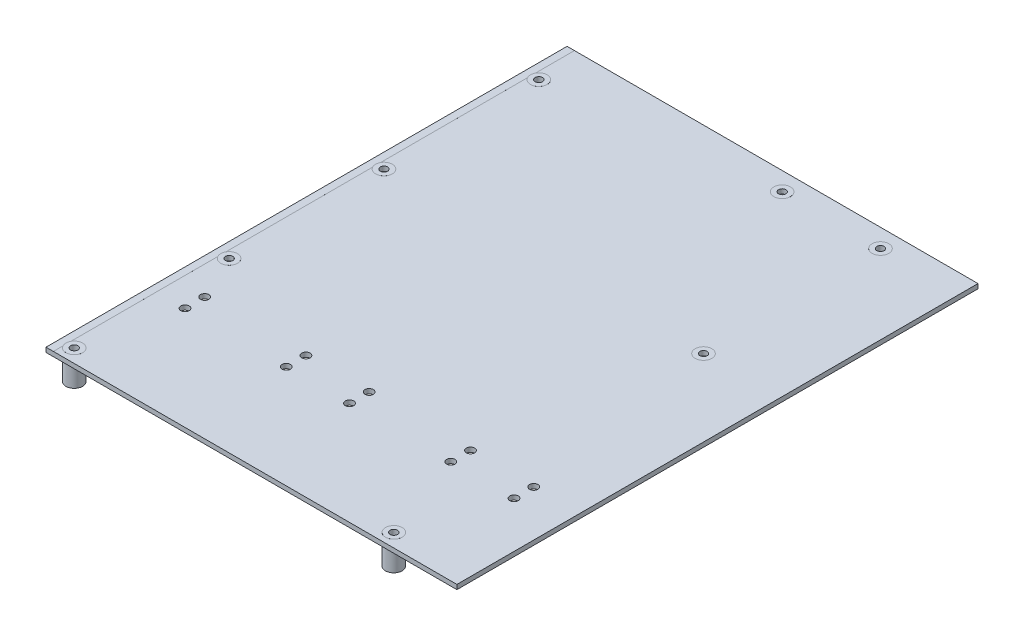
ISO-10303-21;
HEADER;
FILE_DESCRIPTION(('STEP AP214'),'2;1');
FILE_NAME('part.step','',(''),(''),'','','');
FILE_SCHEMA(('AUTOMOTIVE_DESIGN { 1 0 10303 214 1 1 1 1 }'));
ENDSEC;
DATA;
#1=APPLICATION_CONTEXT('core data for automotive mechanical design processes');
#2=APPLICATION_PROTOCOL_DEFINITION('international standard','automotive_design',2000,#1);
#3=PRODUCT_CONTEXT('',#1,'mechanical');
#4=PRODUCT('Part','Part','',(#3));
#5=PRODUCT_RELATED_PRODUCT_CATEGORY('part','',(#4));
#6=PRODUCT_DEFINITION_FORMATION('','',#4);
#7=PRODUCT_DEFINITION_CONTEXT('part definition',#1,'design');
#8=PRODUCT_DEFINITION('design','',#6,#7);
#9=PRODUCT_DEFINITION_SHAPE('','',#8);
#10=(LENGTH_UNIT() NAMED_UNIT(*) SI_UNIT(.MILLI.,.METRE.));
#11=(NAMED_UNIT(*) PLANE_ANGLE_UNIT() SI_UNIT($,.RADIAN.));
#12=(NAMED_UNIT(*) SI_UNIT($,.STERADIAN.) SOLID_ANGLE_UNIT());
#13=UNCERTAINTY_MEASURE_WITH_UNIT(LENGTH_MEASURE(1.E-05),#10,'distance_accuracy_value','');
#14=(GEOMETRIC_REPRESENTATION_CONTEXT(3) GLOBAL_UNCERTAINTY_ASSIGNED_CONTEXT((#13)) GLOBAL_UNIT_ASSIGNED_CONTEXT((#10,
#11,#12)) REPRESENTATION_CONTEXT('',''));
#15=CARTESIAN_POINT('',(0.,0.,0.));
#16=DIRECTION('',(0.,0.,1.));
#17=DIRECTION('',(1.,0.,0.));
#18=AXIS2_PLACEMENT_3D('',#15,#16,#17);
#19=CARTESIAN_POINT('',(-172.72,2.3622,0.));
#20=DIRECTION('',(0.,-1.,0.));
#21=DIRECTION('',(0.,0.,-1.));
#22=AXIS2_PLACEMENT_3D('',#19,#20,#21);
#23=PLANE('',#22);
#24=CARTESIAN_POINT('',(-1.27,2.3622,9.525));
#25=DIRECTION('',(0.,-1.,0.));
#26=DIRECTION('',(0.,0.,-1.));
#27=AXIS2_PLACEMENT_3D('',#24,#25,#26);
#28=CIRCLE('',#27,4.318);
#29=CARTESIAN_POINT('',(-1.27,2.3622,5.207));
#30=VERTEX_POINT('',#29);
#31=EDGE_CURVE('E256',#30,#30,#28,.F.);
#32=ORIENTED_EDGE('',*,*,#31,.F.);
#33=EDGE_LOOP('',(#32));
#34=FACE_BOUND('',#33,.T.);
#35=CARTESIAN_POINT('',(-101.8586,2.3622,205.779379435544));
#36=DIRECTION('',(0.,-1.,0.));
#37=DIRECTION('',(0.,0.,-1.));
#38=AXIS2_PLACEMENT_3D('',#35,#36,#37);
#39=CIRCLE('',#38,2.159);
#40=CARTESIAN_POINT('',(-101.8586,2.3622,203.620379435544));
#41=VERTEX_POINT('',#40);
#42=EDGE_CURVE('E516',#41,#41,#39,.T.);
#43=ORIENTED_EDGE('',*,*,#42,.T.);
#44=EDGE_LOOP('',(#43));
#45=FACE_BOUND('',#44,.T.);
#46=CARTESIAN_POINT('',(-154.1826,2.3622,205.779379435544));
#47=DIRECTION('',(0.,-1.,0.));
#48=DIRECTION('',(0.,0.,-1.));
#49=AXIS2_PLACEMENT_3D('',#46,#47,#48);
#50=CIRCLE('',#49,2.159);
#51=CARTESIAN_POINT('',(-154.1826,2.3622,203.620379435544));
#52=VERTEX_POINT('',#51);
#53=EDGE_CURVE('E511',#52,#52,#50,.T.);
#54=ORIENTED_EDGE('',*,*,#53,.T.);
#55=EDGE_LOOP('',(#54));
#56=FACE_BOUND('',#55,.T.);
#57=CARTESIAN_POINT('',(0.,2.3622,262.255));
#58=DIRECTION('',(0.,-1.,0.));
#59=DIRECTION('',(0.,0.,-1.));
#60=AXIS2_PLACEMENT_3D('',#57,#58,#59);
#61=CIRCLE('',#60,4.318);
#62=CARTESIAN_POINT('',(0.,2.3622,257.937));
#63=VERTEX_POINT('',#62);
#64=EDGE_CURVE('E442',#63,#63,#61,.F.);
#65=ORIENTED_EDGE('',*,*,#64,.F.);
#66=EDGE_LOOP('',(#65));
#67=FACE_BOUND('',#66,.T.);
#68=CARTESIAN_POINT('',(0.,2.3622,102.235));
#69=DIRECTION('',(0.,-1.,0.));
#70=DIRECTION('',(0.,0.,-1.));
#71=AXIS2_PLACEMENT_3D('',#68,#69,#70);
#72=CIRCLE('',#71,4.318);
#73=CARTESIAN_POINT('',(0.,2.3622,97.917));
#74=VERTEX_POINT('',#73);
#75=EDGE_CURVE('E453',#74,#74,#72,.F.);
#76=ORIENTED_EDGE('',*,*,#75,.F.);
#77=EDGE_LOOP('',(#76));
#78=FACE_BOUND('',#77,.T.);
#79=CARTESIAN_POINT('',(-154.1826,2.3622,215.939379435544));
#80=DIRECTION('',(0.,-1.,0.));
#81=DIRECTION('',(0.,0.,-1.));
#82=AXIS2_PLACEMENT_3D('',#79,#80,#81);
#83=CIRCLE('',#82,2.159);
#84=CARTESIAN_POINT('',(-154.1826,2.3622,213.780379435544));
#85=VERTEX_POINT('',#84);
#86=EDGE_CURVE('E308',#85,#85,#83,.T.);
#87=ORIENTED_EDGE('',*,*,#86,.T.);
#88=EDGE_LOOP('',(#87));
#89=FACE_BOUND('',#88,.T.);
#90=CARTESIAN_POINT('',(-101.8586,2.3622,215.939379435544));
#91=DIRECTION('',(0.,-1.,0.));
#92=DIRECTION('',(0.,0.,-1.));
#93=AXIS2_PLACEMENT_3D('',#90,#91,#92);
#94=CIRCLE('',#93,2.159);
#95=CARTESIAN_POINT('',(-101.8586,2.3622,213.780379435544));
#96=VERTEX_POINT('',#95);
#97=EDGE_CURVE('E304',#96,#96,#94,.T.);
#98=ORIENTED_EDGE('',*,*,#97,.T.);
#99=EDGE_LOOP('',(#98));
#100=FACE_BOUND('',#99,.T.);
#101=CARTESIAN_POINT('',(-69.1826,2.3622,215.939379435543));
#102=DIRECTION('',(0.,-1.,0.));
#103=DIRECTION('',(0.,0.,-1.));
#104=AXIS2_PLACEMENT_3D('',#101,#102,#103);
#105=CIRCLE('',#104,2.159);
#106=CARTESIAN_POINT('',(-69.1826,2.3622,213.780379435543));
#107=VERTEX_POINT('',#106);
#108=EDGE_CURVE('E307',#107,#107,#105,.T.);
#109=ORIENTED_EDGE('',*,*,#108,.T.);
#110=EDGE_LOOP('',(#109));
#111=FACE_BOUND('',#110,.T.);
#112=CARTESIAN_POINT('',(-69.1826,2.3622,205.779379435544));
#113=DIRECTION('',(0.,-1.,0.));
#114=DIRECTION('',(0.,0.,-1.));
#115=AXIS2_PLACEMENT_3D('',#112,#113,#114);
#116=CIRCLE('',#115,2.159);
#117=CARTESIAN_POINT('',(-69.1826,2.3622,203.620379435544));
#118=VERTEX_POINT('',#117);
#119=EDGE_CURVE('E523',#118,#118,#116,.T.);
#120=ORIENTED_EDGE('',*,*,#119,.T.);
#121=EDGE_LOOP('',(#120));
#122=FACE_BOUND('',#121,.T.);
#123=CARTESIAN_POINT('',(-16.8586,2.3622,215.939379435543));
#124=DIRECTION('',(0.,-1.,0.));
#125=DIRECTION('',(0.,0.,-1.));
#126=AXIS2_PLACEMENT_3D('',#123,#124,#125);
#127=CIRCLE('',#126,2.159);
#128=CARTESIAN_POINT('',(-16.8586,2.3622,213.780379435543));
#129=VERTEX_POINT('',#128);
#130=EDGE_CURVE('E526',#129,#129,#127,.T.);
#131=ORIENTED_EDGE('',*,*,#130,.T.);
#132=EDGE_LOOP('',(#131));
#133=FACE_BOUND('',#132,.T.);
#134=CARTESIAN_POINT('',(-16.8586,2.3622,205.779379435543));
#135=DIRECTION('',(0.,-1.,0.));
#136=DIRECTION('',(0.,0.,-1.));
#137=AXIS2_PLACEMENT_3D('',#134,#135,#136);
#138=CIRCLE('',#137,2.159);
#139=CARTESIAN_POINT('',(-16.8586,2.3622,203.620379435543));
#140=VERTEX_POINT('',#139);
#141=EDGE_CURVE('E286',#140,#140,#138,.T.);
#142=ORIENTED_EDGE('',*,*,#141,.T.);
#143=EDGE_LOOP('',(#142));
#144=FACE_BOUND('',#143,.T.);
#145=CARTESIAN_POINT('',(15.8174,2.3622,215.939379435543));
#146=DIRECTION('',(0.,-1.,0.));
#147=DIRECTION('',(0.,0.,-1.));
#148=AXIS2_PLACEMENT_3D('',#145,#146,#147);
#149=CIRCLE('',#148,2.159);
#150=CARTESIAN_POINT('',(15.8174,2.3622,213.780379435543));
#151=VERTEX_POINT('',#150);
#152=EDGE_CURVE('E283',#151,#151,#149,.T.);
#153=ORIENTED_EDGE('',*,*,#152,.T.);
#154=EDGE_LOOP('',(#153));
#155=FACE_BOUND('',#154,.T.);
#156=CARTESIAN_POINT('',(15.8174,2.3622,205.779379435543));
#157=DIRECTION('',(0.,-1.,0.));
#158=DIRECTION('',(0.,0.,-1.));
#159=AXIS2_PLACEMENT_3D('',#156,#157,#158);
#160=CIRCLE('',#159,2.159);
#161=CARTESIAN_POINT('',(15.8174,2.3622,203.620379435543));
#162=VERTEX_POINT('',#161);
#163=EDGE_CURVE('E200',#162,#162,#160,.T.);
#164=ORIENTED_EDGE('',*,*,#163,.T.);
#165=EDGE_LOOP('',(#164));
#166=FACE_BOUND('',#165,.T.);
#167=CARTESIAN_POINT('',(-52.07,2.3622,9.525));
#168=DIRECTION('',(0.,-1.,0.));
#169=DIRECTION('',(0.,0.,-1.));
#170=AXIS2_PLACEMENT_3D('',#167,#168,#169);
#171=CIRCLE('',#170,4.318);
#172=CARTESIAN_POINT('',(-52.07,2.3622,5.207));
#173=VERTEX_POINT('',#172);
#174=EDGE_CURVE('E268',#173,#173,#171,.F.);
#175=ORIENTED_EDGE('',*,*,#174,.F.);
#176=EDGE_LOOP('',(#175));
#177=FACE_BOUND('',#176,.T.);
#178=DIRECTION('',(0.,0.,-1.));
#179=VECTOR('',#178,1.);
#180=CARTESIAN_POINT('',(39.5835851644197,2.3622,269.24));
#181=LINE('',#180,#179);
#182=CARTESIAN_POINT('',(39.5835851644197,2.3622,269.24));
#183=VERTEX_POINT('',#182);
#184=CARTESIAN_POINT('',(39.5835851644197,2.3622,0.));
#185=VERTEX_POINT('',#184);
#186=EDGE_CURVE('E41',#183,#185,#181,.T.);
#187=ORIENTED_EDGE('',*,*,#186,.T.);
#188=DIRECTION('',(-1.,0.,0.));
#189=VECTOR('',#188,1.);
#190=CARTESIAN_POINT('',(-172.72,2.3622,0.));
#191=LINE('',#190,#189);
#192=CARTESIAN_POINT('',(-168.91,2.3622,0.));
#193=VERTEX_POINT('',#192);
#194=EDGE_CURVE('E199',#185,#193,#191,.T.);
#195=ORIENTED_EDGE('',*,*,#194,.T.);
#196=DIRECTION('',(0.,0.,-1.));
#197=VECTOR('',#196,1.);
#198=CARTESIAN_POINT('',(-168.91,2.3622,0.));
#199=LINE('',#198,#197);
#200=CARTESIAN_POINT('',(-168.91,2.3622,20.193));
#201=VERTEX_POINT('',#200);
#202=EDGE_CURVE('E363',#201,#193,#199,.T.);
#203=ORIENTED_EDGE('',*,*,#202,.F.);
#204=CARTESIAN_POINT('',(-165.1,2.3622,22.225));
#205=DIRECTION('',(0.,-1.,0.));
#206=DIRECTION('',(0.,0.,-1.));
#207=AXIS2_PLACEMENT_3D('',#204,#205,#206);
#208=CIRCLE('',#207,4.318);
#209=CARTESIAN_POINT('',(-168.91,2.3622,24.257));
#210=VERTEX_POINT('',#209);
#211=EDGE_CURVE('E360',#210,#201,#208,.F.);
#212=ORIENTED_EDGE('',*,*,#211,.F.);
#213=CARTESIAN_POINT('',(-168.91,2.3622,100.203));
#214=VERTEX_POINT('',#213);
#215=EDGE_CURVE('E384',#214,#210,#199,.T.);
#216=ORIENTED_EDGE('',*,*,#215,.F.);
#217=CARTESIAN_POINT('',(-165.1,2.3622,102.235));
#218=DIRECTION('',(0.,-1.,0.));
#219=DIRECTION('',(0.,0.,-1.));
#220=AXIS2_PLACEMENT_3D('',#217,#218,#219);
#221=CIRCLE('',#220,4.318);
#222=CARTESIAN_POINT('',(-168.91,2.3622,104.267));
#223=VERTEX_POINT('',#222);
#224=EDGE_CURVE('E356',#223,#214,#221,.F.);
#225=ORIENTED_EDGE('',*,*,#224,.F.);
#226=CARTESIAN_POINT('',(-168.91,2.3622,180.213));
#227=VERTEX_POINT('',#226);
#228=EDGE_CURVE('E387',#227,#223,#199,.T.);
#229=ORIENTED_EDGE('',*,*,#228,.F.);
#230=CARTESIAN_POINT('',(-165.1,2.3622,182.245));
#231=DIRECTION('',(0.,-1.,0.));
#232=DIRECTION('',(0.,0.,-1.));
#233=AXIS2_PLACEMENT_3D('',#230,#231,#232);
#234=CIRCLE('',#233,4.318);
#235=CARTESIAN_POINT('',(-168.91,2.3622,184.277));
#236=VERTEX_POINT('',#235);
#237=EDGE_CURVE('E351',#236,#227,#234,.F.);
#238=ORIENTED_EDGE('',*,*,#237,.F.);
#239=CARTESIAN_POINT('',(-168.91,2.3622,260.223));
#240=VERTEX_POINT('',#239);
#241=EDGE_CURVE('E364',#240,#236,#199,.T.);
#242=ORIENTED_EDGE('',*,*,#241,.F.);
#243=CARTESIAN_POINT('',(-165.1,2.3622,262.255));
#244=DIRECTION('',(0.,-1.,0.));
#245=DIRECTION('',(0.,0.,-1.));
#246=AXIS2_PLACEMENT_3D('',#243,#244,#245);
#247=CIRCLE('',#246,4.318);
#248=CARTESIAN_POINT('',(-168.91,2.3622,264.287));
#249=VERTEX_POINT('',#248);
#250=EDGE_CURVE('E460',#249,#240,#247,.F.);
#251=ORIENTED_EDGE('',*,*,#250,.F.);
#252=CARTESIAN_POINT('',(-168.91,2.3622,269.24));
#253=VERTEX_POINT('',#252);
#254=EDGE_CURVE('E211',#253,#249,#199,.T.);
#255=ORIENTED_EDGE('',*,*,#254,.F.);
#256=DIRECTION('',(1.,0.,0.));
#257=VECTOR('',#256,1.);
#258=CARTESIAN_POINT('',(-172.72,2.3622,269.24));
#259=LINE('',#258,#257);
#260=EDGE_CURVE('E205',#253,#183,#259,.T.);
#261=ORIENTED_EDGE('',*,*,#260,.T.);
#262=EDGE_LOOP('',(#187,#195,#203,#212,#216,#225,#229,#238,#242,#251,#255,#261));
#263=FACE_BOUND('',#262,.T.);
#264=ADVANCED_FACE('F37',(#34,#45,#56,#67,#78,#89,#100,#111,#122,#133,#144,#155,#166,#177,#263),
#23,.F.);
#265=CARTESIAN_POINT('',(-172.72,0.,0.));
#266=DIRECTION('',(0.,-1.,0.));
#267=DIRECTION('',(0.,0.,-1.));
#268=AXIS2_PLACEMENT_3D('',#265,#266,#267);
#269=PLANE('',#268);
#270=CARTESIAN_POINT('',(-1.27,0.,9.525));
#271=DIRECTION('',(0.,-1.,0.));
#272=DIRECTION('',(0.,0.,-1.));
#273=AXIS2_PLACEMENT_3D('',#270,#271,#272);
#274=CIRCLE('',#273,4.318);
#275=CARTESIAN_POINT('',(-1.27,0.,5.207));
#276=VERTEX_POINT('',#275);
#277=EDGE_CURVE('E212',#276,#276,#274,.F.);
#278=ORIENTED_EDGE('',*,*,#277,.T.);
#279=EDGE_LOOP('',(#278));
#280=FACE_BOUND('',#279,.T.);
#281=CARTESIAN_POINT('',(-101.8586,0.,205.779379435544));
#282=DIRECTION('',(0.,-1.,0.));
#283=DIRECTION('',(0.,0.,-1.));
#284=AXIS2_PLACEMENT_3D('',#281,#282,#283);
#285=CIRCLE('',#284,2.159);
#286=CARTESIAN_POINT('',(-101.8586,0.,203.620379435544));
#287=VERTEX_POINT('',#286);
#288=EDGE_CURVE('E298',#287,#287,#285,.T.);
#289=ORIENTED_EDGE('',*,*,#288,.F.);
#290=EDGE_LOOP('',(#289));
#291=FACE_BOUND('',#290,.T.);
#292=CARTESIAN_POINT('',(-154.1826,0.,205.779379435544));
#293=DIRECTION('',(0.,-1.,0.));
#294=DIRECTION('',(0.,0.,-1.));
#295=AXIS2_PLACEMENT_3D('',#292,#293,#294);
#296=CIRCLE('',#295,2.159);
#297=CARTESIAN_POINT('',(-154.1826,0.,203.620379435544));
#298=VERTEX_POINT('',#297);
#299=EDGE_CURVE('E302',#298,#298,#296,.T.);
#300=ORIENTED_EDGE('',*,*,#299,.F.);
#301=EDGE_LOOP('',(#300));
#302=FACE_BOUND('',#301,.T.);
#303=CARTESIAN_POINT('',(0.,0.,262.255));
#304=DIRECTION('',(0.,-1.,0.));
#305=DIRECTION('',(0.,0.,-1.));
#306=AXIS2_PLACEMENT_3D('',#303,#304,#305);
#307=CIRCLE('',#306,4.318);
#308=CARTESIAN_POINT('',(0.,0.,257.937));
#309=VERTEX_POINT('',#308);
#310=EDGE_CURVE('E215',#309,#309,#307,.F.);
#311=ORIENTED_EDGE('',*,*,#310,.T.);
#312=EDGE_LOOP('',(#311));
#313=FACE_BOUND('',#312,.T.);
#314=CARTESIAN_POINT('',(0.,0.,102.235));
#315=DIRECTION('',(0.,-1.,0.));
#316=DIRECTION('',(0.,0.,-1.));
#317=AXIS2_PLACEMENT_3D('',#314,#315,#316);
#318=CIRCLE('',#317,4.318);
#319=CARTESIAN_POINT('',(0.,0.,97.917));
#320=VERTEX_POINT('',#319);
#321=EDGE_CURVE('E276',#320,#320,#318,.F.);
#322=ORIENTED_EDGE('',*,*,#321,.T.);
#323=EDGE_LOOP('',(#322));
#324=FACE_BOUND('',#323,.T.);
#325=CARTESIAN_POINT('',(-154.1826,0.,215.939379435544));
#326=DIRECTION('',(0.,-1.,0.));
#327=DIRECTION('',(0.,0.,-1.));
#328=AXIS2_PLACEMENT_3D('',#325,#326,#327);
#329=CIRCLE('',#328,2.159);
#330=CARTESIAN_POINT('',(-154.1826,0.,213.780379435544));
#331=VERTEX_POINT('',#330);
#332=EDGE_CURVE('E303',#331,#331,#329,.T.);
#333=ORIENTED_EDGE('',*,*,#332,.F.);
#334=EDGE_LOOP('',(#333));
#335=FACE_BOUND('',#334,.T.);
#336=CARTESIAN_POINT('',(-101.8586,0.,215.939379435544));
#337=DIRECTION('',(0.,-1.,0.));
#338=DIRECTION('',(0.,0.,-1.));
#339=AXIS2_PLACEMENT_3D('',#336,#337,#338);
#340=CIRCLE('',#339,2.159);
#341=CARTESIAN_POINT('',(-101.8586,0.,213.780379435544));
#342=VERTEX_POINT('',#341);
#343=EDGE_CURVE('E299',#342,#342,#340,.T.);
#344=ORIENTED_EDGE('',*,*,#343,.F.);
#345=EDGE_LOOP('',(#344));
#346=FACE_BOUND('',#345,.T.);
#347=CARTESIAN_POINT('',(-69.1826,0.,215.939379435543));
#348=DIRECTION('',(0.,-1.,0.));
#349=DIRECTION('',(0.,0.,-1.));
#350=AXIS2_PLACEMENT_3D('',#347,#348,#349);
#351=CIRCLE('',#350,2.159);
#352=CARTESIAN_POINT('',(-69.1826,0.,213.780379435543));
#353=VERTEX_POINT('',#352);
#354=EDGE_CURVE('E295',#353,#353,#351,.T.);
#355=ORIENTED_EDGE('',*,*,#354,.F.);
#356=EDGE_LOOP('',(#355));
#357=FACE_BOUND('',#356,.T.);
#358=CARTESIAN_POINT('',(-69.1826,0.,205.779379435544));
#359=DIRECTION('',(0.,-1.,0.));
#360=DIRECTION('',(0.,0.,-1.));
#361=AXIS2_PLACEMENT_3D('',#358,#359,#360);
#362=CIRCLE('',#361,2.159);
#363=CARTESIAN_POINT('',(-69.1826,0.,203.620379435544));
#364=VERTEX_POINT('',#363);
#365=EDGE_CURVE('E292',#364,#364,#362,.T.);
#366=ORIENTED_EDGE('',*,*,#365,.F.);
#367=EDGE_LOOP('',(#366));
#368=FACE_BOUND('',#367,.T.);
#369=CARTESIAN_POINT('',(-16.8586,0.,215.939379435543));
#370=DIRECTION('',(0.,-1.,0.));
#371=DIRECTION('',(0.,0.,-1.));
#372=AXIS2_PLACEMENT_3D('',#369,#370,#371);
#373=CIRCLE('',#372,2.159);
#374=CARTESIAN_POINT('',(-16.8586,0.,213.780379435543));
#375=VERTEX_POINT('',#374);
#376=EDGE_CURVE('E289',#375,#375,#373,.T.);
#377=ORIENTED_EDGE('',*,*,#376,.F.);
#378=EDGE_LOOP('',(#377));
#379=FACE_BOUND('',#378,.T.);
#380=CARTESIAN_POINT('',(-16.8586,0.,205.779379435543));
#381=DIRECTION('',(0.,-1.,0.));
#382=DIRECTION('',(0.,0.,-1.));
#383=AXIS2_PLACEMENT_3D('',#380,#381,#382);
#384=CIRCLE('',#383,2.159);
#385=CARTESIAN_POINT('',(-16.8586,0.,203.620379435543));
#386=VERTEX_POINT('',#385);
#387=EDGE_CURVE('E282',#386,#386,#384,.T.);
#388=ORIENTED_EDGE('',*,*,#387,.F.);
#389=EDGE_LOOP('',(#388));
#390=FACE_BOUND('',#389,.T.);
#391=CARTESIAN_POINT('',(15.8174,0.,215.939379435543));
#392=DIRECTION('',(0.,-1.,0.));
#393=DIRECTION('',(0.,0.,-1.));
#394=AXIS2_PLACEMENT_3D('',#391,#392,#393);
#395=CIRCLE('',#394,2.159);
#396=CARTESIAN_POINT('',(15.8174,0.,213.780379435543));
#397=VERTEX_POINT('',#396);
#398=EDGE_CURVE('E279',#397,#397,#395,.T.);
#399=ORIENTED_EDGE('',*,*,#398,.F.);
#400=EDGE_LOOP('',(#399));
#401=FACE_BOUND('',#400,.T.);
#402=CARTESIAN_POINT('',(15.8174,0.,205.779379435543));
#403=DIRECTION('',(0.,-1.,0.));
#404=DIRECTION('',(0.,0.,-1.));
#405=AXIS2_PLACEMENT_3D('',#402,#403,#404);
#406=CIRCLE('',#405,2.159);
#407=CARTESIAN_POINT('',(15.8174,0.,203.620379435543));
#408=VERTEX_POINT('',#407);
#409=EDGE_CURVE('E272',#408,#408,#406,.T.);
#410=ORIENTED_EDGE('',*,*,#409,.F.);
#411=EDGE_LOOP('',(#410));
#412=FACE_BOUND('',#411,.T.);
#413=CARTESIAN_POINT('',(-52.07,0.,9.525));
#414=DIRECTION('',(0.,-1.,0.));
#415=DIRECTION('',(0.,0.,-1.));
#416=AXIS2_PLACEMENT_3D('',#413,#414,#415);
#417=CIRCLE('',#416,4.318);
#418=CARTESIAN_POINT('',(-52.07,0.,5.207));
#419=VERTEX_POINT('',#418);
#420=EDGE_CURVE('E273',#419,#419,#417,.F.);
#421=ORIENTED_EDGE('',*,*,#420,.T.);
#422=EDGE_LOOP('',(#421));
#423=FACE_BOUND('',#422,.T.);
#424=DIRECTION('',(-1.,0.,0.));
#425=VECTOR('',#424,1.);
#426=CARTESIAN_POINT('',(-172.72,0.,0.));
#427=LINE('',#426,#425);
#428=CARTESIAN_POINT('',(39.5835851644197,0.,0.));
#429=VERTEX_POINT('',#428);
#430=CARTESIAN_POINT('',(-168.91,0.,0.));
#431=VERTEX_POINT('',#430);
#432=EDGE_CURVE('E208',#429,#431,#427,.T.);
#433=ORIENTED_EDGE('',*,*,#432,.F.);
#434=DIRECTION('',(0.,0.,1.));
#435=VECTOR('',#434,1.);
#436=CARTESIAN_POINT('',(39.5835851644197,0.,0.));
#437=LINE('',#436,#435);
#438=CARTESIAN_POINT('',(39.5835851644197,0.,269.24));
#439=VERTEX_POINT('',#438);
#440=EDGE_CURVE('E55',#429,#439,#437,.T.);
#441=ORIENTED_EDGE('',*,*,#440,.T.);
#442=DIRECTION('',(1.,0.,0.));
#443=VECTOR('',#442,1.);
#444=CARTESIAN_POINT('',(-172.72,0.,269.24));
#445=LINE('',#444,#443);
#446=CARTESIAN_POINT('',(-168.91,0.,269.24));
#447=VERTEX_POINT('',#446);
#448=EDGE_CURVE('E207',#447,#439,#445,.T.);
#449=ORIENTED_EDGE('',*,*,#448,.F.);
#450=DIRECTION('',(0.,0.,-1.));
#451=VECTOR('',#450,1.);
#452=CARTESIAN_POINT('',(-168.91,0.,0.));
#453=LINE('',#452,#451);
#454=CARTESIAN_POINT('',(-168.91,0.,264.287));
#455=VERTEX_POINT('',#454);
#456=EDGE_CURVE('E370',#447,#455,#453,.T.);
#457=ORIENTED_EDGE('',*,*,#456,.T.);
#458=CARTESIAN_POINT('',(-165.1,0.,262.255));
#459=DIRECTION('',(0.,-1.,0.));
#460=DIRECTION('',(0.,0.,-1.));
#461=AXIS2_PLACEMENT_3D('',#458,#459,#460);
#462=CIRCLE('',#461,4.318);
#463=CARTESIAN_POINT('',(-168.91,0.,260.223));
#464=VERTEX_POINT('',#463);
#465=EDGE_CURVE('E372',#455,#464,#462,.F.);
#466=ORIENTED_EDGE('',*,*,#465,.T.);
#467=CARTESIAN_POINT('',(-168.91,0.,184.277));
#468=VERTEX_POINT('',#467);
#469=EDGE_CURVE('E374',#464,#468,#453,.T.);
#470=ORIENTED_EDGE('',*,*,#469,.T.);
#471=CARTESIAN_POINT('',(-165.1,0.,182.245));
#472=DIRECTION('',(0.,-1.,0.));
#473=DIRECTION('',(0.,0.,-1.));
#474=AXIS2_PLACEMENT_3D('',#471,#472,#473);
#475=CIRCLE('',#474,4.318);
#476=CARTESIAN_POINT('',(-168.91,0.,180.213));
#477=VERTEX_POINT('',#476);
#478=EDGE_CURVE('E493',#468,#477,#475,.F.);
#479=ORIENTED_EDGE('',*,*,#478,.T.);
#480=CARTESIAN_POINT('',(-168.91,0.,104.267));
#481=VERTEX_POINT('',#480);
#482=EDGE_CURVE('E492',#477,#481,#453,.T.);
#483=ORIENTED_EDGE('',*,*,#482,.T.);
#484=CARTESIAN_POINT('',(-165.1,0.,102.235));
#485=DIRECTION('',(0.,-1.,0.));
#486=DIRECTION('',(0.,0.,-1.));
#487=AXIS2_PLACEMENT_3D('',#484,#485,#486);
#488=CIRCLE('',#487,4.318);
#489=CARTESIAN_POINT('',(-168.91,0.,100.203));
#490=VERTEX_POINT('',#489);
#491=EDGE_CURVE('E489',#481,#490,#488,.F.);
#492=ORIENTED_EDGE('',*,*,#491,.T.);
#493=CARTESIAN_POINT('',(-168.91,0.,24.257));
#494=VERTEX_POINT('',#493);
#495=EDGE_CURVE('E484',#490,#494,#453,.T.);
#496=ORIENTED_EDGE('',*,*,#495,.T.);
#497=CARTESIAN_POINT('',(-165.1,0.,22.225));
#498=DIRECTION('',(0.,-1.,0.));
#499=DIRECTION('',(0.,0.,-1.));
#500=AXIS2_PLACEMENT_3D('',#497,#498,#499);
#501=CIRCLE('',#500,4.318);
#502=CARTESIAN_POINT('',(-168.91,0.,20.193));
#503=VERTEX_POINT('',#502);
#504=EDGE_CURVE('E481',#494,#503,#501,.F.);
#505=ORIENTED_EDGE('',*,*,#504,.T.);
#506=EDGE_CURVE('E373',#503,#431,#453,.T.);
#507=ORIENTED_EDGE('',*,*,#506,.T.);
#508=EDGE_LOOP('',(#433,#441,#449,#457,#466,#470,#479,#483,#492,#496,#505,#507));
#509=FACE_BOUND('',#508,.T.);
#510=ADVANCED_FACE('F537',(#280,#291,#302,#313,#324,#335,#346,#357,#368,#379,#390,#401,#412,
#423,#509),#269,.T.);
#511=CARTESIAN_POINT('',(-172.72,2.3622,269.24));
#512=DIRECTION('',(1.,0.,0.));
#513=DIRECTION('',(0.,0.,-1.));
#514=AXIS2_PLACEMENT_3D('',#511,#512,#513);
#515=PLANE('',#514);
#516=DIRECTION('',(0.,-1.,0.));
#517=VECTOR('',#516,1.);
#518=CARTESIAN_POINT('',(-172.72,2.3622,269.24));
#519=LINE('',#518,#517);
#520=CARTESIAN_POINT('',(-172.72,2.36347,269.24));
#521=VERTEX_POINT('',#520);
#522=CARTESIAN_POINT('',(-172.72,-0.00126999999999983,269.24));
#523=VERTEX_POINT('',#522);
#524=EDGE_CURVE('E315',#521,#523,#519,.T.);
#525=ORIENTED_EDGE('',*,*,#524,.F.);
#526=DIRECTION('',(0.,0.,1.));
#527=VECTOR('',#526,1.);
#528=CARTESIAN_POINT('',(-172.72,2.36347,0.));
#529=LINE('',#528,#527);
#530=CARTESIAN_POINT('',(-172.72,2.36347,0.));
#531=VERTEX_POINT('',#530);
#532=EDGE_CURVE('E331',#531,#521,#529,.T.);
#533=ORIENTED_EDGE('',*,*,#532,.F.);
#534=DIRECTION('',(0.,-1.,0.));
#535=VECTOR('',#534,1.);
#536=CARTESIAN_POINT('',(-172.72,2.3622,0.));
#537=LINE('',#536,#535);
#538=CARTESIAN_POINT('',(-172.72,-0.00126999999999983,0.));
#539=VERTEX_POINT('',#538);
#540=EDGE_CURVE('E316',#531,#539,#537,.T.);
#541=ORIENTED_EDGE('',*,*,#540,.T.);
#542=DIRECTION('',(0.,0.,1.));
#543=VECTOR('',#542,1.);
#544=CARTESIAN_POINT('',(-172.72,-0.00126999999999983,0.));
#545=LINE('',#544,#543);
#546=EDGE_CURVE('E312',#539,#523,#545,.T.);
#547=ORIENTED_EDGE('',*,*,#546,.T.);
#548=EDGE_LOOP('',(#525,#533,#541,#547));
#549=FACE_BOUND('',#548,.T.);
#550=ADVANCED_FACE('F556',(#549),#515,.F.);
#551=CARTESIAN_POINT('',(-172.72,2.3622,269.24));
#552=DIRECTION('',(0.,0.,-1.));
#553=DIRECTION('',(-1.,0.,0.));
#554=AXIS2_PLACEMENT_3D('',#551,#552,#553);
#555=PLANE('',#554);
#556=ORIENTED_EDGE('',*,*,#260,.F.);
#557=DIRECTION('',(0.,-1.,0.));
#558=VECTOR('',#557,1.);
#559=CARTESIAN_POINT('',(-168.91,2.36347,269.24));
#560=LINE('',#559,#558);
#561=CARTESIAN_POINT('',(-168.91,2.36347,269.24));
#562=VERTEX_POINT('',#561);
#563=EDGE_CURVE('E345',#562,#253,#560,.T.);
#564=ORIENTED_EDGE('',*,*,#563,.F.);
#565=DIRECTION('',(1.,0.,0.));
#566=VECTOR('',#565,1.);
#567=CARTESIAN_POINT('',(-172.72,2.36347,269.24));
#568=LINE('',#567,#566);
#569=EDGE_CURVE('E334',#521,#562,#568,.T.);
#570=ORIENTED_EDGE('',*,*,#569,.F.);
#571=ORIENTED_EDGE('',*,*,#524,.T.);
#572=DIRECTION('',(1.,0.,0.));
#573=VECTOR('',#572,1.);
#574=CARTESIAN_POINT('',(-172.72,-0.00126999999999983,269.24));
#575=LINE('',#574,#573);
#576=CARTESIAN_POINT('',(-168.91,-0.00126999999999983,269.24));
#577=VERTEX_POINT('',#576);
#578=EDGE_CURVE('E317',#523,#577,#575,.T.);
#579=ORIENTED_EDGE('',*,*,#578,.T.);
#580=EDGE_CURVE('E323',#447,#577,#560,.T.);
#581=ORIENTED_EDGE('',*,*,#580,.F.);
#582=ORIENTED_EDGE('',*,*,#448,.T.);
#583=DIRECTION('',(0.,1.,0.));
#584=VECTOR('',#583,1.);
#585=CARTESIAN_POINT('',(39.5835851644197,-23.0378,269.24));
#586=LINE('',#585,#584);
#587=EDGE_CURVE('E195',#439,#183,#586,.T.);
#588=ORIENTED_EDGE('',*,*,#587,.T.);
#589=EDGE_LOOP('',(#556,#564,#570,#571,#579,#581,#582,#588));
#590=FACE_BOUND('',#589,.T.);
#591=ADVANCED_FACE('F39',(#590),#555,.F.);
#592=CARTESIAN_POINT('',(-172.72,2.3622,0.));
#593=DIRECTION('',(0.,0.,1.));
#594=DIRECTION('',(1.,0.,0.));
#595=AXIS2_PLACEMENT_3D('',#592,#593,#594);
#596=PLANE('',#595);
#597=ORIENTED_EDGE('',*,*,#540,.F.);
#598=DIRECTION('',(-1.,0.,0.));
#599=VECTOR('',#598,1.);
#600=CARTESIAN_POINT('',(-172.72,2.36347,0.));
#601=LINE('',#600,#599);
#602=CARTESIAN_POINT('',(-168.91,2.36347,0.));
#603=VERTEX_POINT('',#602);
#604=EDGE_CURVE('E335',#603,#531,#601,.T.);
#605=ORIENTED_EDGE('',*,*,#604,.F.);
#606=DIRECTION('',(0.,-1.,0.));
#607=VECTOR('',#606,1.);
#608=CARTESIAN_POINT('',(-168.91,2.36347,0.));
#609=LINE('',#608,#607);
#610=EDGE_CURVE('E329',#603,#193,#609,.T.);
#611=ORIENTED_EDGE('',*,*,#610,.T.);
#612=ORIENTED_EDGE('',*,*,#194,.F.);
#613=DIRECTION('',(0.,1.,0.));
#614=VECTOR('',#613,1.);
#615=CARTESIAN_POINT('',(39.5835851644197,-23.0378,0.));
#616=LINE('',#615,#614);
#617=EDGE_CURVE('E12',#429,#185,#616,.T.);
#618=ORIENTED_EDGE('',*,*,#617,.F.);
#619=ORIENTED_EDGE('',*,*,#432,.T.);
#620=CARTESIAN_POINT('',(-168.91,-0.00126999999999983,0.));
#621=VERTEX_POINT('',#620);
#622=EDGE_CURVE('E330',#431,#621,#609,.T.);
#623=ORIENTED_EDGE('',*,*,#622,.T.);
#624=DIRECTION('',(-1.,0.,0.));
#625=VECTOR('',#624,1.);
#626=CARTESIAN_POINT('',(-172.72,-0.00126999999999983,0.));
#627=LINE('',#626,#625);
#628=EDGE_CURVE('E326',#621,#539,#627,.T.);
#629=ORIENTED_EDGE('',*,*,#628,.T.);
#630=EDGE_LOOP('',(#597,#605,#611,#612,#618,#619,#623,#629));
#631=FACE_BOUND('',#630,.T.);
#632=ADVANCED_FACE('F544',(#631),#596,.F.);
#633=CARTESIAN_POINT('',(-165.1,2.3749,22.225));
#634=DIRECTION('',(0.,-1.,0.));
#635=DIRECTION('',(0.,0.,-1.));
#636=AXIS2_PLACEMENT_3D('',#633,#634,#635);
#637=CYLINDRICAL_SURFACE('',#636,4.318);
#638=CARTESIAN_POINT('',(-165.1,2.3749,22.225));
#639=DIRECTION('',(0.,1.,0.));
#640=DIRECTION('',(0.,0.,1.));
#641=AXIS2_PLACEMENT_3D('',#638,#639,#640);
#642=CIRCLE('',#641,4.318);
#643=CARTESIAN_POINT('',(-165.1,2.3749,26.543));
#644=VERTEX_POINT('',#643);
#645=EDGE_CURVE('E463',#644,#644,#642,.T.);
#646=ORIENTED_EDGE('',*,*,#645,.F.);
#647=EDGE_LOOP('',(#646));
#648=FACE_BOUND('',#647,.T.);
#649=DIRECTION('',(0.,-1.,0.));
#650=VECTOR('',#649,1.);
#651=CARTESIAN_POINT('',(-168.91,2.3749,20.193));
#652=LINE('',#651,#650);
#653=CARTESIAN_POINT('',(-168.91,2.36347,20.193));
#654=VERTEX_POINT('',#653);
#655=EDGE_CURVE('E397',#654,#201,#652,.T.);
#656=ORIENTED_EDGE('',*,*,#655,.F.);
#657=CARTESIAN_POINT('',(-165.1,2.36347,22.225));
#658=DIRECTION('',(0.,1.,0.));
#659=DIRECTION('',(0.,0.,1.));
#660=AXIS2_PLACEMENT_3D('',#657,#658,#659);
#661=CIRCLE('',#660,4.318);
#662=CARTESIAN_POINT('',(-168.91,2.36347,24.257));
#663=VERTEX_POINT('',#662);
#664=EDGE_CURVE('E344',#654,#663,#661,.T.);
#665=ORIENTED_EDGE('',*,*,#664,.T.);
#666=DIRECTION('',(0.,-1.,0.));
#667=VECTOR('',#666,1.);
#668=CARTESIAN_POINT('',(-168.91,2.3749,24.257));
#669=LINE('',#668,#667);
#670=EDGE_CURVE('E398',#210,#663,#669,.F.);
#671=ORIENTED_EDGE('',*,*,#670,.F.);
#672=ORIENTED_EDGE('',*,*,#211,.T.);
#673=EDGE_LOOP('',(#656,#665,#671,#672));
#674=FACE_BOUND('',#673,.T.);
#675=ADVANCED_FACE('F574',(#648,#674),#637,.T.);
#676=CARTESIAN_POINT('',(-165.1,2.3749,102.235));
#677=DIRECTION('',(0.,-1.,0.));
#678=DIRECTION('',(0.,0.,-1.));
#679=AXIS2_PLACEMENT_3D('',#676,#677,#678);
#680=CYLINDRICAL_SURFACE('',#679,4.318);
#681=CARTESIAN_POINT('',(-165.1,-0.0127,102.235));
#682=DIRECTION('',(0.,1.,0.));
#683=DIRECTION('',(0.,0.,1.));
#684=AXIS2_PLACEMENT_3D('',#681,#682,#683);
#685=CIRCLE('',#684,4.318);
#686=CARTESIAN_POINT('',(-165.1,-0.0127,106.553));
#687=VERTEX_POINT('',#686);
#688=EDGE_CURVE('E357',#687,#687,#685,.T.);
#689=ORIENTED_EDGE('',*,*,#688,.T.);
#690=EDGE_LOOP('',(#689));
#691=FACE_BOUND('',#690,.T.);
#692=DIRECTION('',(0.,-1.,0.));
#693=VECTOR('',#692,1.);
#694=CARTESIAN_POINT('',(-168.91,2.3749,100.203));
#695=LINE('',#694,#693);
#696=CARTESIAN_POINT('',(-168.91,-0.00126999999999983,100.203));
#697=VERTEX_POINT('',#696);
#698=EDGE_CURVE('E400',#490,#697,#695,.T.);
#699=ORIENTED_EDGE('',*,*,#698,.F.);
#700=ORIENTED_EDGE('',*,*,#491,.F.);
#701=DIRECTION('',(0.,-1.,0.));
#702=VECTOR('',#701,1.);
#703=CARTESIAN_POINT('',(-168.91,2.3749,104.267));
#704=LINE('',#703,#702);
#705=CARTESIAN_POINT('',(-168.91,-0.00126999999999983,104.267));
#706=VERTEX_POINT('',#705);
#707=EDGE_CURVE('E391',#706,#481,#704,.F.);
#708=ORIENTED_EDGE('',*,*,#707,.F.);
#709=CARTESIAN_POINT('',(-165.1,-0.00126999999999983,102.235));
#710=DIRECTION('',(0.,1.,0.));
#711=DIRECTION('',(0.,0.,1.));
#712=AXIS2_PLACEMENT_3D('',#709,#710,#711);
#713=CIRCLE('',#712,4.318);
#714=EDGE_CURVE('E414',#697,#706,#713,.T.);
#715=ORIENTED_EDGE('',*,*,#714,.F.);
#716=EDGE_LOOP('',(#699,#700,#708,#715));
#717=FACE_BOUND('',#716,.T.);
#718=ADVANCED_FACE('F631',(#691,#717),#680,.T.);
#719=DIRECTION('',(0.,-1.,0.));
#720=VECTOR('',#719,1.);
#721=CARTESIAN_POINT('',(-168.91,2.3749,20.193));
#722=LINE('',#721,#720);
#723=CARTESIAN_POINT('',(-168.91,-0.00126999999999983,20.193));
#724=VERTEX_POINT('',#723);
#725=EDGE_CURVE('E378',#503,#724,#722,.T.);
#726=ORIENTED_EDGE('',*,*,#725,.F.);
#727=ORIENTED_EDGE('',*,*,#504,.F.);
#728=DIRECTION('',(0.,-1.,0.));
#729=VECTOR('',#728,1.);
#730=CARTESIAN_POINT('',(-168.91,2.3749,24.257));
#731=LINE('',#730,#729);
#732=CARTESIAN_POINT('',(-168.91,-0.00126999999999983,24.257));
#733=VERTEX_POINT('',#732);
#734=EDGE_CURVE('E403',#733,#494,#731,.F.);
#735=ORIENTED_EDGE('',*,*,#734,.F.);
#736=CARTESIAN_POINT('',(-165.1,-0.00126999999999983,22.225));
#737=DIRECTION('',(0.,1.,0.));
#738=DIRECTION('',(0.,0.,1.));
#739=AXIS2_PLACEMENT_3D('',#736,#737,#738);
#740=CIRCLE('',#739,4.318);
#741=EDGE_CURVE('E415',#724,#733,#740,.T.);
#742=ORIENTED_EDGE('',*,*,#741,.F.);
#743=EDGE_LOOP('',(#726,#727,#735,#742));
#744=FACE_BOUND('',#743,.T.);
#745=CARTESIAN_POINT('',(-165.1,-12.7127,22.225));
#746=DIRECTION('',(0.,-1.,0.));
#747=DIRECTION('',(0.,0.,-1.));
#748=AXIS2_PLACEMENT_3D('',#745,#746,#747);
#749=CIRCLE('',#748,4.31799999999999);
#750=CARTESIAN_POINT('',(-165.1,-12.7127,17.907));
#751=VERTEX_POINT('',#750);
#752=EDGE_CURVE('E232',#751,#751,#749,.T.);
#753=ORIENTED_EDGE('',*,*,#752,.F.);
#754=EDGE_LOOP('',(#753));
#755=FACE_BOUND('',#754,.T.);
#756=ADVANCED_FACE('F622',(#744,#755),#637,.T.);
#757=CARTESIAN_POINT('',(-165.1,2.3749,102.235));
#758=DIRECTION('',(0.,1.,0.));
#759=DIRECTION('',(0.,0.,1.));
#760=AXIS2_PLACEMENT_3D('',#757,#758,#759);
#761=CIRCLE('',#760,4.318);
#762=CARTESIAN_POINT('',(-165.1,2.3749,106.553));
#763=VERTEX_POINT('',#762);
#764=EDGE_CURVE('E439',#763,#763,#761,.T.);
#765=ORIENTED_EDGE('',*,*,#764,.F.);
#766=EDGE_LOOP('',(#765));
#767=FACE_BOUND('',#766,.T.);
#768=DIRECTION('',(0.,-1.,0.));
#769=VECTOR('',#768,1.);
#770=CARTESIAN_POINT('',(-168.91,2.3749,100.203));
#771=LINE('',#770,#769);
#772=CARTESIAN_POINT('',(-168.91,2.36347,100.203));
#773=VERTEX_POINT('',#772);
#774=EDGE_CURVE('E395',#773,#214,#771,.T.);
#775=ORIENTED_EDGE('',*,*,#774,.F.);
#776=CARTESIAN_POINT('',(-165.1,2.36347,102.235));
#777=DIRECTION('',(0.,1.,0.));
#778=DIRECTION('',(0.,0.,1.));
#779=AXIS2_PLACEMENT_3D('',#776,#777,#778);
#780=CIRCLE('',#779,4.318);
#781=CARTESIAN_POINT('',(-168.91,2.36347,104.267));
#782=VERTEX_POINT('',#781);
#783=EDGE_CURVE('E353',#773,#782,#780,.T.);
#784=ORIENTED_EDGE('',*,*,#783,.T.);
#785=DIRECTION('',(0.,-1.,0.));
#786=VECTOR('',#785,1.);
#787=CARTESIAN_POINT('',(-168.91,2.3749,104.267));
#788=LINE('',#787,#786);
#789=EDGE_CURVE('E385',#223,#782,#788,.F.);
#790=ORIENTED_EDGE('',*,*,#789,.F.);
#791=ORIENTED_EDGE('',*,*,#224,.T.);
#792=EDGE_LOOP('',(#775,#784,#790,#791));
#793=FACE_BOUND('',#792,.T.);
#794=ADVANCED_FACE('F635',(#767,#793),#680,.T.);
#795=CARTESIAN_POINT('',(-165.1,2.3749,182.245));
#796=DIRECTION('',(0.,-1.,0.));
#797=DIRECTION('',(0.,0.,-1.));
#798=AXIS2_PLACEMENT_3D('',#795,#796,#797);
#799=CYLINDRICAL_SURFACE('',#798,4.318);
#800=CARTESIAN_POINT('',(-165.1,-0.0127,182.245));
#801=DIRECTION('',(0.,1.,0.));
#802=DIRECTION('',(0.,0.,1.));
#803=AXIS2_PLACEMENT_3D('',#800,#801,#802);
#804=CIRCLE('',#803,4.318);
#805=CARTESIAN_POINT('',(-165.1,-0.0127,186.563));
#806=VERTEX_POINT('',#805);
#807=EDGE_CURVE('E352',#806,#806,#804,.T.);
#808=ORIENTED_EDGE('',*,*,#807,.T.);
#809=EDGE_LOOP('',(#808));
#810=FACE_BOUND('',#809,.T.);
#811=DIRECTION('',(0.,-1.,0.));
#812=VECTOR('',#811,1.);
#813=CARTESIAN_POINT('',(-168.91,2.3749,180.213));
#814=LINE('',#813,#812);
#815=CARTESIAN_POINT('',(-168.91,-0.00126999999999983,180.213));
#816=VERTEX_POINT('',#815);
#817=EDGE_CURVE('E388',#477,#816,#814,.T.);
#818=ORIENTED_EDGE('',*,*,#817,.F.);
#819=ORIENTED_EDGE('',*,*,#478,.F.);
#820=DIRECTION('',(0.,-1.,0.));
#821=VECTOR('',#820,1.);
#822=CARTESIAN_POINT('',(-168.91,2.3749,184.277));
#823=LINE('',#822,#821);
#824=CARTESIAN_POINT('',(-168.91,-0.00126999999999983,184.277));
#825=VERTEX_POINT('',#824);
#826=EDGE_CURVE('E379',#825,#468,#823,.F.);
#827=ORIENTED_EDGE('',*,*,#826,.F.);
#828=CARTESIAN_POINT('',(-165.1,-0.00126999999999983,182.245));
#829=DIRECTION('',(0.,1.,0.));
#830=DIRECTION('',(0.,0.,1.));
#831=AXIS2_PLACEMENT_3D('',#828,#829,#830);
#832=CIRCLE('',#831,4.318);
#833=EDGE_CURVE('E410',#816,#825,#832,.T.);
#834=ORIENTED_EDGE('',*,*,#833,.F.);
#835=EDGE_LOOP('',(#818,#819,#827,#834));
#836=FACE_BOUND('',#835,.T.);
#837=ADVANCED_FACE('F645',(#810,#836),#799,.T.);
#838=CARTESIAN_POINT('',(-165.1,2.3749,182.245));
#839=DIRECTION('',(0.,1.,0.));
#840=DIRECTION('',(0.,0.,1.));
#841=AXIS2_PLACEMENT_3D('',#838,#839,#840);
#842=CIRCLE('',#841,4.318);
#843=CARTESIAN_POINT('',(-165.1,2.3749,186.563));
#844=VERTEX_POINT('',#843);
#845=EDGE_CURVE('E438',#844,#844,#842,.T.);
#846=ORIENTED_EDGE('',*,*,#845,.F.);
#847=EDGE_LOOP('',(#846));
#848=FACE_BOUND('',#847,.T.);
#849=DIRECTION('',(0.,-1.,0.));
#850=VECTOR('',#849,1.);
#851=CARTESIAN_POINT('',(-168.91,2.3749,180.213));
#852=LINE('',#851,#850);
#853=CARTESIAN_POINT('',(-168.91,2.36347,180.213));
#854=VERTEX_POINT('',#853);
#855=EDGE_CURVE('E382',#854,#227,#852,.T.);
#856=ORIENTED_EDGE('',*,*,#855,.F.);
#857=CARTESIAN_POINT('',(-165.1,2.36347,182.245));
#858=DIRECTION('',(0.,1.,0.));
#859=DIRECTION('',(0.,0.,1.));
#860=AXIS2_PLACEMENT_3D('',#857,#858,#859);
#861=CIRCLE('',#860,4.318);
#862=CARTESIAN_POINT('',(-168.91,2.36347,184.277));
#863=VERTEX_POINT('',#862);
#864=EDGE_CURVE('E348',#854,#863,#861,.T.);
#865=ORIENTED_EDGE('',*,*,#864,.T.);
#866=DIRECTION('',(0.,-1.,0.));
#867=VECTOR('',#866,1.);
#868=CARTESIAN_POINT('',(-168.91,2.3749,184.277));
#869=LINE('',#868,#867);
#870=EDGE_CURVE('E365',#236,#863,#869,.F.);
#871=ORIENTED_EDGE('',*,*,#870,.F.);
#872=ORIENTED_EDGE('',*,*,#237,.T.);
#873=EDGE_LOOP('',(#856,#865,#871,#872));
#874=FACE_BOUND('',#873,.T.);
#875=ADVANCED_FACE('F589',(#848,#874),#799,.T.);
#876=CARTESIAN_POINT('',(-165.1,2.3749,262.255));
#877=DIRECTION('',(0.,-1.,0.));
#878=DIRECTION('',(0.,0.,-1.));
#879=AXIS2_PLACEMENT_3D('',#876,#877,#878);
#880=CYLINDRICAL_SURFACE('',#879,4.318);
#881=DIRECTION('',(0.,-1.,0.));
#882=VECTOR('',#881,1.);
#883=CARTESIAN_POINT('',(-168.91,2.3749,260.223));
#884=LINE('',#883,#882);
#885=CARTESIAN_POINT('',(-168.91,-0.00126999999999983,260.223));
#886=VERTEX_POINT('',#885);
#887=EDGE_CURVE('E375',#464,#886,#884,.T.);
#888=ORIENTED_EDGE('',*,*,#887,.F.);
#889=ORIENTED_EDGE('',*,*,#465,.F.);
#890=DIRECTION('',(0.,-1.,0.));
#891=VECTOR('',#890,1.);
#892=CARTESIAN_POINT('',(-168.91,2.3749,264.287));
#893=LINE('',#892,#891);
#894=CARTESIAN_POINT('',(-168.91,-0.00126999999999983,264.287));
#895=VERTEX_POINT('',#894);
#896=EDGE_CURVE('E311',#895,#455,#893,.F.);
#897=ORIENTED_EDGE('',*,*,#896,.F.);
#898=CARTESIAN_POINT('',(-165.1,-0.00126999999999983,262.255));
#899=DIRECTION('',(0.,1.,0.));
#900=DIRECTION('',(0.,0.,1.));
#901=AXIS2_PLACEMENT_3D('',#898,#899,#900);
#902=CIRCLE('',#901,4.318);
#903=EDGE_CURVE('E413',#886,#895,#902,.T.);
#904=ORIENTED_EDGE('',*,*,#903,.F.);
#905=EDGE_LOOP('',(#888,#889,#897,#904));
#906=FACE_BOUND('',#905,.T.);
#907=CARTESIAN_POINT('',(-165.1,-12.7127,262.255));
#908=DIRECTION('',(0.,-1.,0.));
#909=DIRECTION('',(0.,0.,-1.));
#910=AXIS2_PLACEMENT_3D('',#907,#908,#909);
#911=CIRCLE('',#910,4.31799999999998);
#912=CARTESIAN_POINT('',(-165.1,-12.7127,257.937));
#913=VERTEX_POINT('',#912);
#914=EDGE_CURVE('E236',#913,#913,#911,.T.);
#915=ORIENTED_EDGE('',*,*,#914,.F.);
#916=EDGE_LOOP('',(#915));
#917=FACE_BOUND('',#916,.T.);
#918=ADVANCED_FACE('F609',(#906,#917),#880,.T.);
#919=CARTESIAN_POINT('',(-165.1,2.3749,262.255));
#920=DIRECTION('',(0.,1.,0.));
#921=DIRECTION('',(0.,0.,1.));
#922=AXIS2_PLACEMENT_3D('',#919,#920,#921);
#923=CIRCLE('',#922,4.318);
#924=CARTESIAN_POINT('',(-165.1,2.3749,266.573));
#925=VERTEX_POINT('',#924);
#926=EDGE_CURVE('E428',#925,#925,#923,.T.);
#927=ORIENTED_EDGE('',*,*,#926,.F.);
#928=EDGE_LOOP('',(#927));
#929=FACE_BOUND('',#928,.T.);
#930=DIRECTION('',(0.,-1.,0.));
#931=VECTOR('',#930,1.);
#932=CARTESIAN_POINT('',(-168.91,2.3749,260.223));
#933=LINE('',#932,#931);
#934=CARTESIAN_POINT('',(-168.91,2.36347,260.223));
#935=VERTEX_POINT('',#934);
#936=EDGE_CURVE('E367',#935,#240,#933,.T.);
#937=ORIENTED_EDGE('',*,*,#936,.F.);
#938=CARTESIAN_POINT('',(-165.1,2.36347,262.255));
#939=DIRECTION('',(0.,1.,0.));
#940=DIRECTION('',(0.,0.,1.));
#941=AXIS2_PLACEMENT_3D('',#938,#939,#940);
#942=CIRCLE('',#941,4.318);
#943=CARTESIAN_POINT('',(-168.91,2.36347,264.287));
#944=VERTEX_POINT('',#943);
#945=EDGE_CURVE('E464',#935,#944,#942,.T.);
#946=ORIENTED_EDGE('',*,*,#945,.T.);
#947=DIRECTION('',(0.,-1.,0.));
#948=VECTOR('',#947,1.);
#949=CARTESIAN_POINT('',(-168.91,2.3749,264.287));
#950=LINE('',#949,#948);
#951=EDGE_CURVE('E362',#249,#944,#950,.F.);
#952=ORIENTED_EDGE('',*,*,#951,.F.);
#953=ORIENTED_EDGE('',*,*,#250,.T.);
#954=EDGE_LOOP('',(#937,#946,#952,#953));
#955=FACE_BOUND('',#954,.T.);
#956=ADVANCED_FACE('F600',(#929,#955),#880,.T.);
#957=CARTESIAN_POINT('',(-165.1,2.3749,22.225));
#958=DIRECTION('',(0.,1.,0.));
#959=DIRECTION('',(0.,0.,1.));
#960=AXIS2_PLACEMENT_3D('',#957,#958,#959);
#961=PLANE('',#960);
#962=CARTESIAN_POINT('',(-165.1,2.3749,22.225));
#963=DIRECTION('',(0.,1.,0.));
#964=DIRECTION('',(0.,0.,1.));
#965=AXIS2_PLACEMENT_3D('',#962,#963,#964);
#966=CIRCLE('',#965,1.905);
#967=CARTESIAN_POINT('',(-165.1,2.3749,24.13));
#968=VERTEX_POINT('',#967);
#969=EDGE_CURVE('E248',#968,#968,#966,.T.);
#970=ORIENTED_EDGE('',*,*,#969,.F.);
#971=EDGE_LOOP('',(#970));
#972=FACE_BOUND('',#971,.T.);
#973=ORIENTED_EDGE('',*,*,#645,.T.);
#974=EDGE_LOOP('',(#973));
#975=FACE_BOUND('',#974,.T.);
#976=ADVANCED_FACE('F1179',(#972,#975),#961,.T.);
#977=CARTESIAN_POINT('',(-165.1,-0.0127,22.225));
#978=DIRECTION('',(0.,1.,0.));
#979=DIRECTION('',(0.,0.,1.));
#980=AXIS2_PLACEMENT_3D('',#977,#978,#979);
#981=CYLINDRICAL_SURFACE('',#980,1.905);
#982=ORIENTED_EDGE('',*,*,#969,.T.);
#983=EDGE_LOOP('',(#982));
#984=FACE_BOUND('',#983,.T.);
#985=CARTESIAN_POINT('',(-165.1,-12.7127,22.225));
#986=DIRECTION('',(0.,-1.,0.));
#987=DIRECTION('',(0.,0.,-1.));
#988=AXIS2_PLACEMENT_3D('',#985,#986,#987);
#989=CIRCLE('',#988,1.90499999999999);
#990=CARTESIAN_POINT('',(-165.1,-12.7127,20.32));
#991=VERTEX_POINT('',#990);
#992=EDGE_CURVE('E244',#991,#991,#989,.T.);
#993=ORIENTED_EDGE('',*,*,#992,.T.);
#994=EDGE_LOOP('',(#993));
#995=FACE_BOUND('',#994,.T.);
#996=ADVANCED_FACE('F806',(#984,#995),#981,.F.);
#997=CARTESIAN_POINT('',(-165.1,-0.0127,102.235));
#998=DIRECTION('',(0.,1.,0.));
#999=DIRECTION('',(0.,0.,1.));
#1000=AXIS2_PLACEMENT_3D('',#997,#998,#999);
#1001=PLANE('',#1000);
#1002=CARTESIAN_POINT('',(-165.1,-0.0127,102.235));
#1003=DIRECTION('',(0.,1.,0.));
#1004=DIRECTION('',(0.,0.,1.));
#1005=AXIS2_PLACEMENT_3D('',#1002,#1003,#1004);
#1006=CIRCLE('',#1005,1.905);
#1007=CARTESIAN_POINT('',(-165.1,-0.0127,104.14));
#1008=VERTEX_POINT('',#1007);
#1009=EDGE_CURVE('E247',#1008,#1008,#1006,.T.);
#1010=ORIENTED_EDGE('',*,*,#1009,.T.);
#1011=EDGE_LOOP('',(#1010));
#1012=FACE_BOUND('',#1011,.T.);
#1013=ORIENTED_EDGE('',*,*,#688,.F.);
#1014=EDGE_LOOP('',(#1013));
#1015=FACE_BOUND('',#1014,.T.);
#1016=ADVANCED_FACE('F804',(#1012,#1015),#1001,.F.);
#1017=CARTESIAN_POINT('',(-165.1,2.3749,102.235));
#1018=DIRECTION('',(0.,1.,0.));
#1019=DIRECTION('',(0.,0.,1.));
#1020=AXIS2_PLACEMENT_3D('',#1017,#1018,#1019);
#1021=PLANE('',#1020);
#1022=CARTESIAN_POINT('',(-165.1,2.3749,102.235));
#1023=DIRECTION('',(0.,1.,0.));
#1024=DIRECTION('',(0.,0.,1.));
#1025=AXIS2_PLACEMENT_3D('',#1022,#1023,#1024);
#1026=CIRCLE('',#1025,1.905);
#1027=CARTESIAN_POINT('',(-165.1,2.3749,104.14));
#1028=VERTEX_POINT('',#1027);
#1029=EDGE_CURVE('E434',#1028,#1028,#1026,.T.);
#1030=ORIENTED_EDGE('',*,*,#1029,.F.);
#1031=EDGE_LOOP('',(#1030));
#1032=FACE_BOUND('',#1031,.T.);
#1033=ORIENTED_EDGE('',*,*,#764,.T.);
#1034=EDGE_LOOP('',(#1033));
#1035=FACE_BOUND('',#1034,.T.);
#1036=ADVANCED_FACE('F796',(#1032,#1035),#1021,.T.);
#1037=CARTESIAN_POINT('',(-165.1,-0.0127,182.245));
#1038=DIRECTION('',(0.,1.,0.));
#1039=DIRECTION('',(0.,0.,1.));
#1040=AXIS2_PLACEMENT_3D('',#1037,#1038,#1039);
#1041=PLANE('',#1040);
#1042=CARTESIAN_POINT('',(-165.1,-0.0127,182.245));
#1043=DIRECTION('',(0.,1.,0.));
#1044=DIRECTION('',(0.,0.,1.));
#1045=AXIS2_PLACEMENT_3D('',#1042,#1043,#1044);
#1046=CIRCLE('',#1045,1.905);
#1047=CARTESIAN_POINT('',(-165.1,-0.0127,184.15));
#1048=VERTEX_POINT('',#1047);
#1049=EDGE_CURVE('E435',#1048,#1048,#1046,.T.);
#1050=ORIENTED_EDGE('',*,*,#1049,.T.);
#1051=EDGE_LOOP('',(#1050));
#1052=FACE_BOUND('',#1051,.T.);
#1053=ORIENTED_EDGE('',*,*,#807,.F.);
#1054=EDGE_LOOP('',(#1053));
#1055=FACE_BOUND('',#1054,.T.);
#1056=ADVANCED_FACE('F793',(#1052,#1055),#1041,.F.);
#1057=CARTESIAN_POINT('',(-165.1,2.3749,182.245));
#1058=DIRECTION('',(0.,1.,0.));
#1059=DIRECTION('',(0.,0.,1.));
#1060=AXIS2_PLACEMENT_3D('',#1057,#1058,#1059);
#1061=PLANE('',#1060);
#1062=CARTESIAN_POINT('',(-165.1,2.3749,182.245));
#1063=DIRECTION('',(0.,1.,0.));
#1064=DIRECTION('',(0.,0.,1.));
#1065=AXIS2_PLACEMENT_3D('',#1062,#1063,#1064);
#1066=CIRCLE('',#1065,1.905);
#1067=CARTESIAN_POINT('',(-165.1,2.3749,184.15));
#1068=VERTEX_POINT('',#1067);
#1069=EDGE_CURVE('E431',#1068,#1068,#1066,.T.);
#1070=ORIENTED_EDGE('',*,*,#1069,.F.);
#1071=EDGE_LOOP('',(#1070));
#1072=FACE_BOUND('',#1071,.T.);
#1073=ORIENTED_EDGE('',*,*,#845,.T.);
#1074=EDGE_LOOP('',(#1073));
#1075=FACE_BOUND('',#1074,.T.);
#1076=ADVANCED_FACE('F789',(#1072,#1075),#1061,.T.);
#1077=CARTESIAN_POINT('',(-165.1,2.3749,262.255));
#1078=DIRECTION('',(0.,1.,0.));
#1079=DIRECTION('',(0.,0.,1.));
#1080=AXIS2_PLACEMENT_3D('',#1077,#1078,#1079);
#1081=PLANE('',#1080);
#1082=CARTESIAN_POINT('',(-165.1,2.3749,262.255));
#1083=DIRECTION('',(0.,1.,0.));
#1084=DIRECTION('',(0.,0.,1.));
#1085=AXIS2_PLACEMENT_3D('',#1082,#1083,#1084);
#1086=CIRCLE('',#1085,1.905);
#1087=CARTESIAN_POINT('',(-165.1,2.3749,264.16));
#1088=VERTEX_POINT('',#1087);
#1089=EDGE_CURVE('E241',#1088,#1088,#1086,.T.);
#1090=ORIENTED_EDGE('',*,*,#1089,.F.);
#1091=EDGE_LOOP('',(#1090));
#1092=FACE_BOUND('',#1091,.T.);
#1093=ORIENTED_EDGE('',*,*,#926,.T.);
#1094=EDGE_LOOP('',(#1093));
#1095=FACE_BOUND('',#1094,.T.);
#1096=ADVANCED_FACE('F778',(#1092,#1095),#1081,.T.);
#1097=CARTESIAN_POINT('',(0.,-0.0127,102.235));
#1098=DIRECTION('',(0.,1.,0.));
#1099=DIRECTION('',(0.,0.,1.));
#1100=AXIS2_PLACEMENT_3D('',#1097,#1098,#1099);
#1101=PLANE('',#1100);
#1102=CARTESIAN_POINT('',(0.,-0.0127,102.235));
#1103=DIRECTION('',(0.,1.,0.));
#1104=DIRECTION('',(0.,0.,1.));
#1105=AXIS2_PLACEMENT_3D('',#1102,#1103,#1104);
#1106=CIRCLE('',#1105,1.905);
#1107=CARTESIAN_POINT('',(0.,-0.0127,104.14));
#1108=VERTEX_POINT('',#1107);
#1109=EDGE_CURVE('E424',#1108,#1108,#1106,.T.);
#1110=ORIENTED_EDGE('',*,*,#1109,.T.);
#1111=EDGE_LOOP('',(#1110));
#1112=FACE_BOUND('',#1111,.T.);
#1113=CARTESIAN_POINT('',(0.,-0.0127,102.235));
#1114=DIRECTION('',(0.,1.,0.));
#1115=DIRECTION('',(0.,0.,1.));
#1116=AXIS2_PLACEMENT_3D('',#1113,#1114,#1115);
#1117=CIRCLE('',#1116,4.318);
#1118=CARTESIAN_POINT('',(0.,-0.0127,106.553));
#1119=VERTEX_POINT('',#1118);
#1120=EDGE_CURVE('E427',#1119,#1119,#1117,.T.);
#1121=ORIENTED_EDGE('',*,*,#1120,.F.);
#1122=EDGE_LOOP('',(#1121));
#1123=FACE_BOUND('',#1122,.T.);
#1124=ADVANCED_FACE('F774',(#1112,#1123),#1101,.F.);
#1125=CARTESIAN_POINT('',(0.,2.3749,102.235));
#1126=DIRECTION('',(0.,-1.,0.));
#1127=DIRECTION('',(0.,0.,-1.));
#1128=AXIS2_PLACEMENT_3D('',#1125,#1126,#1127);
#1129=CYLINDRICAL_SURFACE('',#1128,4.318);
#1130=ORIENTED_EDGE('',*,*,#321,.F.);
#1131=EDGE_LOOP('',(#1130));
#1132=FACE_BOUND('',#1131,.T.);
#1133=ORIENTED_EDGE('',*,*,#1120,.T.);
#1134=EDGE_LOOP('',(#1133));
#1135=FACE_BOUND('',#1134,.T.);
#1136=ADVANCED_FACE('F777',(#1132,#1135),#1129,.T.);
#1137=CARTESIAN_POINT('',(0.,2.3749,102.235));
#1138=DIRECTION('',(0.,1.,0.));
#1139=DIRECTION('',(0.,0.,1.));
#1140=AXIS2_PLACEMENT_3D('',#1137,#1138,#1139);
#1141=CIRCLE('',#1140,4.318);
#1142=CARTESIAN_POINT('',(0.,2.3749,106.553));
#1143=VERTEX_POINT('',#1142);
#1144=EDGE_CURVE('E448',#1143,#1143,#1141,.T.);
#1145=ORIENTED_EDGE('',*,*,#1144,.F.);
#1146=EDGE_LOOP('',(#1145));
#1147=FACE_BOUND('',#1146,.T.);
#1148=ORIENTED_EDGE('',*,*,#75,.T.);
#1149=EDGE_LOOP('',(#1148));
#1150=FACE_BOUND('',#1149,.T.);
#1151=ADVANCED_FACE('F782',(#1147,#1150),#1129,.T.);
#1152=CARTESIAN_POINT('',(0.,2.3749,102.235));
#1153=DIRECTION('',(0.,1.,0.));
#1154=DIRECTION('',(0.,0.,1.));
#1155=AXIS2_PLACEMENT_3D('',#1152,#1153,#1154);
#1156=PLANE('',#1155);
#1157=CARTESIAN_POINT('',(0.,2.3749,102.235));
#1158=DIRECTION('',(0.,1.,0.));
#1159=DIRECTION('',(0.,0.,1.));
#1160=AXIS2_PLACEMENT_3D('',#1157,#1158,#1159);
#1161=CIRCLE('',#1160,1.905);
#1162=CARTESIAN_POINT('',(0.,2.3749,104.14));
#1163=VERTEX_POINT('',#1162);
#1164=EDGE_CURVE('E240',#1163,#1163,#1161,.T.);
#1165=ORIENTED_EDGE('',*,*,#1164,.F.);
#1166=EDGE_LOOP('',(#1165));
#1167=FACE_BOUND('',#1166,.T.);
#1168=ORIENTED_EDGE('',*,*,#1144,.T.);
#1169=EDGE_LOOP('',(#1168));
#1170=FACE_BOUND('',#1169,.T.);
#1171=ADVANCED_FACE('F769',(#1167,#1170),#1156,.T.);
#1172=CARTESIAN_POINT('',(0.,2.3749,262.255));
#1173=DIRECTION('',(0.,1.,0.));
#1174=DIRECTION('',(0.,0.,1.));
#1175=AXIS2_PLACEMENT_3D('',#1172,#1173,#1174);
#1176=PLANE('',#1175);
#1177=CARTESIAN_POINT('',(0.,2.3749,262.255));
#1178=DIRECTION('',(0.,1.,0.));
#1179=DIRECTION('',(0.,0.,1.));
#1180=AXIS2_PLACEMENT_3D('',#1177,#1178,#1179);
#1181=CIRCLE('',#1180,1.905);
#1182=CARTESIAN_POINT('',(0.,2.3749,264.16));
#1183=VERTEX_POINT('',#1182);
#1184=EDGE_CURVE('E225',#1183,#1183,#1181,.T.);
#1185=ORIENTED_EDGE('',*,*,#1184,.F.);
#1186=EDGE_LOOP('',(#1185));
#1187=FACE_BOUND('',#1186,.T.);
#1188=CARTESIAN_POINT('',(0.,2.3749,262.255));
#1189=DIRECTION('',(0.,1.,0.));
#1190=DIRECTION('',(0.,0.,1.));
#1191=AXIS2_PLACEMENT_3D('',#1188,#1189,#1190);
#1192=CIRCLE('',#1191,4.318);
#1193=CARTESIAN_POINT('',(0.,2.3749,266.573));
#1194=VERTEX_POINT('',#1193);
#1195=EDGE_CURVE('E445',#1194,#1194,#1192,.T.);
#1196=ORIENTED_EDGE('',*,*,#1195,.T.);
#1197=EDGE_LOOP('',(#1196));
#1198=FACE_BOUND('',#1197,.T.);
#1199=ADVANCED_FACE('F765',(#1187,#1198),#1176,.T.);
#1200=CARTESIAN_POINT('',(0.,2.3749,262.255));
#1201=DIRECTION('',(0.,-1.,0.));
#1202=DIRECTION('',(0.,0.,-1.));
#1203=AXIS2_PLACEMENT_3D('',#1200,#1201,#1202);
#1204=CYLINDRICAL_SURFACE('',#1203,4.318);
#1205=ORIENTED_EDGE('',*,*,#1195,.F.);
#1206=EDGE_LOOP('',(#1205));
#1207=FACE_BOUND('',#1206,.T.);
#1208=ORIENTED_EDGE('',*,*,#64,.T.);
#1209=EDGE_LOOP('',(#1208));
#1210=FACE_BOUND('',#1209,.T.);
#1211=ADVANCED_FACE('F768',(#1207,#1210),#1204,.T.);
#1212=ORIENTED_EDGE('',*,*,#310,.F.);
#1213=EDGE_LOOP('',(#1212));
#1214=FACE_BOUND('',#1213,.T.);
#1215=CARTESIAN_POINT('',(0.,-12.7127,262.255));
#1216=DIRECTION('',(0.,-1.,0.));
#1217=DIRECTION('',(0.,0.,-1.));
#1218=AXIS2_PLACEMENT_3D('',#1215,#1216,#1217);
#1219=CIRCLE('',#1218,4.31799999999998);
#1220=CARTESIAN_POINT('',(0.,-12.7127,257.937));
#1221=VERTEX_POINT('',#1220);
#1222=EDGE_CURVE('E47',#1221,#1221,#1219,.T.);
#1223=ORIENTED_EDGE('',*,*,#1222,.F.);
#1224=EDGE_LOOP('',(#1223));
#1225=FACE_BOUND('',#1224,.T.);
#1226=ADVANCED_FACE('F763',(#1214,#1225),#1204,.T.);
#1227=CARTESIAN_POINT('',(-165.1,-0.0127,102.235));
#1228=DIRECTION('',(0.,1.,0.));
#1229=DIRECTION('',(0.,0.,1.));
#1230=AXIS2_PLACEMENT_3D('',#1227,#1228,#1229);
#1231=CYLINDRICAL_SURFACE('',#1230,1.905);
#1232=ORIENTED_EDGE('',*,*,#1009,.F.);
#1233=EDGE_LOOP('',(#1232));
#1234=FACE_BOUND('',#1233,.T.);
#1235=ORIENTED_EDGE('',*,*,#1029,.T.);
#1236=EDGE_LOOP('',(#1235));
#1237=FACE_BOUND('',#1236,.T.);
#1238=ADVANCED_FACE('F759',(#1234,#1237),#1231,.F.);
#1239=CARTESIAN_POINT('',(-165.1,-0.0127,182.245));
#1240=DIRECTION('',(0.,1.,0.));
#1241=DIRECTION('',(0.,0.,1.));
#1242=AXIS2_PLACEMENT_3D('',#1239,#1240,#1241);
#1243=CYLINDRICAL_SURFACE('',#1242,1.905);
#1244=ORIENTED_EDGE('',*,*,#1049,.F.);
#1245=EDGE_LOOP('',(#1244));
#1246=FACE_BOUND('',#1245,.T.);
#1247=ORIENTED_EDGE('',*,*,#1069,.T.);
#1248=EDGE_LOOP('',(#1247));
#1249=FACE_BOUND('',#1248,.T.);
#1250=ADVANCED_FACE('F755',(#1246,#1249),#1243,.F.);
#1251=CARTESIAN_POINT('',(-165.1,-0.0127,262.255));
#1252=DIRECTION('',(0.,1.,0.));
#1253=DIRECTION('',(0.,0.,1.));
#1254=AXIS2_PLACEMENT_3D('',#1251,#1252,#1253);
#1255=CYLINDRICAL_SURFACE('',#1254,1.905);
#1256=ORIENTED_EDGE('',*,*,#1089,.T.);
#1257=EDGE_LOOP('',(#1256));
#1258=FACE_BOUND('',#1257,.T.);
#1259=CARTESIAN_POINT('',(-165.1,-12.7127,262.255));
#1260=DIRECTION('',(0.,-1.,0.));
#1261=DIRECTION('',(0.,0.,-1.));
#1262=AXIS2_PLACEMENT_3D('',#1259,#1260,#1261);
#1263=CIRCLE('',#1262,1.905);
#1264=CARTESIAN_POINT('',(-165.1,-12.7127,260.35));
#1265=VERTEX_POINT('',#1264);
#1266=EDGE_CURVE('E237',#1265,#1265,#1263,.T.);
#1267=ORIENTED_EDGE('',*,*,#1266,.T.);
#1268=EDGE_LOOP('',(#1267));
#1269=FACE_BOUND('',#1268,.T.);
#1270=ADVANCED_FACE('F751',(#1258,#1269),#1255,.F.);
#1271=CARTESIAN_POINT('',(0.,-0.0127,102.235));
#1272=DIRECTION('',(0.,1.,0.));
#1273=DIRECTION('',(0.,0.,1.));
#1274=AXIS2_PLACEMENT_3D('',#1271,#1272,#1273);
#1275=CYLINDRICAL_SURFACE('',#1274,1.905);
#1276=ORIENTED_EDGE('',*,*,#1109,.F.);
#1277=EDGE_LOOP('',(#1276));
#1278=FACE_BOUND('',#1277,.T.);
#1279=ORIENTED_EDGE('',*,*,#1164,.T.);
#1280=EDGE_LOOP('',(#1279));
#1281=FACE_BOUND('',#1280,.T.);
#1282=ADVANCED_FACE('F747',(#1278,#1281),#1275,.F.);
#1283=CARTESIAN_POINT('',(0.,-0.0127,262.255));
#1284=DIRECTION('',(0.,1.,0.));
#1285=DIRECTION('',(0.,0.,1.));
#1286=AXIS2_PLACEMENT_3D('',#1283,#1284,#1285);
#1287=CYLINDRICAL_SURFACE('',#1286,1.905);
#1288=ORIENTED_EDGE('',*,*,#1184,.T.);
#1289=EDGE_LOOP('',(#1288));
#1290=FACE_BOUND('',#1289,.T.);
#1291=CARTESIAN_POINT('',(0.,-12.7127,262.255));
#1292=DIRECTION('',(0.,-1.,0.));
#1293=DIRECTION('',(0.,0.,-1.));
#1294=AXIS2_PLACEMENT_3D('',#1291,#1292,#1293);
#1295=CIRCLE('',#1294,1.905);
#1296=CARTESIAN_POINT('',(0.,-12.7127,260.35));
#1297=VERTEX_POINT('',#1296);
#1298=EDGE_CURVE('E221',#1297,#1297,#1295,.T.);
#1299=ORIENTED_EDGE('',*,*,#1298,.T.);
#1300=EDGE_LOOP('',(#1299));
#1301=FACE_BOUND('',#1300,.T.);
#1302=ADVANCED_FACE('F742',(#1290,#1301),#1287,.F.);
#1303=CARTESIAN_POINT('',(-172.72,2.36347,269.24));
#1304=DIRECTION('',(0.,1.,0.));
#1305=DIRECTION('',(0.,0.,1.));
#1306=AXIS2_PLACEMENT_3D('',#1303,#1304,#1305);
#1307=PLANE('',#1306);
#1308=ORIENTED_EDGE('',*,*,#664,.F.);
#1309=DIRECTION('',(0.,0.,-1.));
#1310=VECTOR('',#1309,1.);
#1311=CARTESIAN_POINT('',(-168.91,2.36347,0.));
#1312=LINE('',#1311,#1310);
#1313=EDGE_CURVE('E224',#654,#603,#1312,.T.);
#1314=ORIENTED_EDGE('',*,*,#1313,.T.);
#1315=ORIENTED_EDGE('',*,*,#604,.T.);
#1316=ORIENTED_EDGE('',*,*,#532,.T.);
#1317=ORIENTED_EDGE('',*,*,#569,.T.);
#1318=EDGE_CURVE('E337',#562,#944,#1312,.T.);
#1319=ORIENTED_EDGE('',*,*,#1318,.T.);
#1320=ORIENTED_EDGE('',*,*,#945,.F.);
#1321=EDGE_CURVE('E339',#935,#863,#1312,.T.);
#1322=ORIENTED_EDGE('',*,*,#1321,.T.);
#1323=ORIENTED_EDGE('',*,*,#864,.F.);
#1324=EDGE_CURVE('E580',#854,#782,#1312,.T.);
#1325=ORIENTED_EDGE('',*,*,#1324,.T.);
#1326=ORIENTED_EDGE('',*,*,#783,.F.);
#1327=EDGE_CURVE('E347',#773,#663,#1312,.T.);
#1328=ORIENTED_EDGE('',*,*,#1327,.T.);
#1329=EDGE_LOOP('',(#1308,#1314,#1315,#1316,#1317,#1319,#1320,#1322,#1323,#1325,#1326,#1328));
#1330=FACE_BOUND('',#1329,.T.);
#1331=ADVANCED_FACE('F561',(#1330),#1307,.T.);
#1332=CARTESIAN_POINT('',(-168.91,2.36347,0.));
#1333=DIRECTION('',(-1.,0.,0.));
#1334=DIRECTION('',(0.,0.,1.));
#1335=AXIS2_PLACEMENT_3D('',#1332,#1333,#1334);
#1336=PLANE('',#1335);
#1337=ORIENTED_EDGE('',*,*,#563,.T.);
#1338=ORIENTED_EDGE('',*,*,#254,.T.);
#1339=ORIENTED_EDGE('',*,*,#951,.T.);
#1340=ORIENTED_EDGE('',*,*,#1318,.F.);
#1341=EDGE_LOOP('',(#1337,#1338,#1339,#1340));
#1342=FACE_BOUND('',#1341,.T.);
#1343=ADVANCED_FACE('F603',(#1342),#1336,.F.);
#1344=ORIENTED_EDGE('',*,*,#241,.T.);
#1345=ORIENTED_EDGE('',*,*,#870,.T.);
#1346=ORIENTED_EDGE('',*,*,#1321,.F.);
#1347=ORIENTED_EDGE('',*,*,#936,.T.);
#1348=EDGE_LOOP('',(#1344,#1345,#1346,#1347));
#1349=FACE_BOUND('',#1348,.T.);
#1350=ADVANCED_FACE('F597',(#1349),#1336,.F.);
#1351=ORIENTED_EDGE('',*,*,#228,.T.);
#1352=ORIENTED_EDGE('',*,*,#789,.T.);
#1353=ORIENTED_EDGE('',*,*,#1324,.F.);
#1354=ORIENTED_EDGE('',*,*,#855,.T.);
#1355=EDGE_LOOP('',(#1351,#1352,#1353,#1354));
#1356=FACE_BOUND('',#1355,.T.);
#1357=ADVANCED_FACE('F593',(#1356),#1336,.F.);
#1358=ORIENTED_EDGE('',*,*,#215,.T.);
#1359=ORIENTED_EDGE('',*,*,#670,.T.);
#1360=ORIENTED_EDGE('',*,*,#1327,.F.);
#1361=ORIENTED_EDGE('',*,*,#774,.T.);
#1362=EDGE_LOOP('',(#1358,#1359,#1360,#1361));
#1363=FACE_BOUND('',#1362,.T.);
#1364=ADVANCED_FACE('F577',(#1363),#1336,.F.);
#1365=ORIENTED_EDGE('',*,*,#655,.T.);
#1366=ORIENTED_EDGE('',*,*,#202,.T.);
#1367=ORIENTED_EDGE('',*,*,#610,.F.);
#1368=ORIENTED_EDGE('',*,*,#1313,.F.);
#1369=EDGE_LOOP('',(#1365,#1366,#1367,#1368));
#1370=FACE_BOUND('',#1369,.T.);
#1371=ADVANCED_FACE('F568',(#1370),#1336,.F.);
#1372=CARTESIAN_POINT('',(-172.72,-0.00126999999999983,269.24));
#1373=DIRECTION('',(0.,1.,0.));
#1374=DIRECTION('',(0.,0.,1.));
#1375=AXIS2_PLACEMENT_3D('',#1372,#1373,#1374);
#1376=PLANE('',#1375);
#1377=DIRECTION('',(0.,0.,-1.));
#1378=VECTOR('',#1377,1.);
#1379=CARTESIAN_POINT('',(-168.91,-0.00126999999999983,0.));
#1380=LINE('',#1379,#1378);
#1381=EDGE_CURVE('E406',#697,#733,#1380,.T.);
#1382=ORIENTED_EDGE('',*,*,#1381,.F.);
#1383=ORIENTED_EDGE('',*,*,#714,.T.);
#1384=EDGE_CURVE('E394',#816,#706,#1380,.T.);
#1385=ORIENTED_EDGE('',*,*,#1384,.F.);
#1386=ORIENTED_EDGE('',*,*,#833,.T.);
#1387=EDGE_CURVE('E325',#886,#825,#1380,.T.);
#1388=ORIENTED_EDGE('',*,*,#1387,.F.);
#1389=ORIENTED_EDGE('',*,*,#903,.T.);
#1390=EDGE_CURVE('E320',#577,#895,#1380,.T.);
#1391=ORIENTED_EDGE('',*,*,#1390,.F.);
#1392=ORIENTED_EDGE('',*,*,#578,.F.);
#1393=ORIENTED_EDGE('',*,*,#546,.F.);
#1394=ORIENTED_EDGE('',*,*,#628,.F.);
#1395=EDGE_CURVE('E324',#724,#621,#1380,.T.);
#1396=ORIENTED_EDGE('',*,*,#1395,.F.);
#1397=ORIENTED_EDGE('',*,*,#741,.T.);
#1398=EDGE_LOOP('',(#1382,#1383,#1385,#1386,#1388,#1389,#1391,#1392,#1393,#1394,#1396,#1397));
#1399=FACE_BOUND('',#1398,.T.);
#1400=ADVANCED_FACE('F552',(#1399),#1376,.F.);
#1401=ORIENTED_EDGE('',*,*,#1381,.T.);
#1402=ORIENTED_EDGE('',*,*,#734,.T.);
#1403=ORIENTED_EDGE('',*,*,#495,.F.);
#1404=ORIENTED_EDGE('',*,*,#698,.T.);
#1405=EDGE_LOOP('',(#1401,#1402,#1403,#1404));
#1406=FACE_BOUND('',#1405,.T.);
#1407=ADVANCED_FACE('F625',(#1406),#1336,.F.);
#1408=ORIENTED_EDGE('',*,*,#1384,.T.);
#1409=ORIENTED_EDGE('',*,*,#707,.T.);
#1410=ORIENTED_EDGE('',*,*,#482,.F.);
#1411=ORIENTED_EDGE('',*,*,#817,.T.);
#1412=EDGE_LOOP('',(#1408,#1409,#1410,#1411));
#1413=FACE_BOUND('',#1412,.T.);
#1414=ADVANCED_FACE('F629',(#1413),#1336,.F.);
#1415=ORIENTED_EDGE('',*,*,#1387,.T.);
#1416=ORIENTED_EDGE('',*,*,#826,.T.);
#1417=ORIENTED_EDGE('',*,*,#469,.F.);
#1418=ORIENTED_EDGE('',*,*,#887,.T.);
#1419=EDGE_LOOP('',(#1415,#1416,#1417,#1418));
#1420=FACE_BOUND('',#1419,.T.);
#1421=ADVANCED_FACE('F614',(#1420),#1336,.F.);
#1422=ORIENTED_EDGE('',*,*,#506,.F.);
#1423=ORIENTED_EDGE('',*,*,#725,.T.);
#1424=ORIENTED_EDGE('',*,*,#1395,.T.);
#1425=ORIENTED_EDGE('',*,*,#622,.F.);
#1426=EDGE_LOOP('',(#1422,#1423,#1424,#1425));
#1427=FACE_BOUND('',#1426,.T.);
#1428=ADVANCED_FACE('F548',(#1427),#1336,.F.);
#1429=ORIENTED_EDGE('',*,*,#456,.F.);
#1430=ORIENTED_EDGE('',*,*,#580,.T.);
#1431=ORIENTED_EDGE('',*,*,#1390,.T.);
#1432=ORIENTED_EDGE('',*,*,#896,.T.);
#1433=EDGE_LOOP('',(#1429,#1430,#1431,#1432));
#1434=FACE_BOUND('',#1433,.T.);
#1435=ADVANCED_FACE('F605',(#1434),#1336,.F.);
#1436=CARTESIAN_POINT('',(-154.1826,2.3749,215.939379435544));
#1437=DIRECTION('',(0.,-1.,0.));
#1438=DIRECTION('',(0.,0.,-1.));
#1439=AXIS2_PLACEMENT_3D('',#1436,#1437,#1438);
#1440=CYLINDRICAL_SURFACE('',#1439,2.159);
#1441=ORIENTED_EDGE('',*,*,#332,.T.);
#1442=EDGE_LOOP('',(#1441));
#1443=FACE_BOUND('',#1442,.T.);
#1444=ORIENTED_EDGE('',*,*,#86,.F.);
#1445=EDGE_LOOP('',(#1444));
#1446=FACE_BOUND('',#1445,.T.);
#1447=ADVANCED_FACE('F733',(#1443,#1446),#1440,.F.);
#1448=CARTESIAN_POINT('',(-101.8586,2.3749,215.939379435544));
#1449=DIRECTION('',(0.,-1.,0.));
#1450=DIRECTION('',(0.,0.,-1.));
#1451=AXIS2_PLACEMENT_3D('',#1448,#1449,#1450);
#1452=CYLINDRICAL_SURFACE('',#1451,2.159);
#1453=ORIENTED_EDGE('',*,*,#343,.T.);
#1454=EDGE_LOOP('',(#1453));
#1455=FACE_BOUND('',#1454,.T.);
#1456=ORIENTED_EDGE('',*,*,#97,.F.);
#1457=EDGE_LOOP('',(#1456));
#1458=FACE_BOUND('',#1457,.T.);
#1459=ADVANCED_FACE('F729',(#1455,#1458),#1452,.F.);
#1460=CARTESIAN_POINT('',(-154.1826,2.3749,205.779379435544));
#1461=DIRECTION('',(0.,-1.,0.));
#1462=DIRECTION('',(0.,0.,-1.));
#1463=AXIS2_PLACEMENT_3D('',#1460,#1461,#1462);
#1464=CYLINDRICAL_SURFACE('',#1463,2.159);
#1465=ORIENTED_EDGE('',*,*,#299,.T.);
#1466=EDGE_LOOP('',(#1465));
#1467=FACE_BOUND('',#1466,.T.);
#1468=ORIENTED_EDGE('',*,*,#53,.F.);
#1469=EDGE_LOOP('',(#1468));
#1470=FACE_BOUND('',#1469,.T.);
#1471=ADVANCED_FACE('F732',(#1467,#1470),#1464,.F.);
#1472=CARTESIAN_POINT('',(-101.8586,2.3749,205.779379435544));
#1473=DIRECTION('',(0.,-1.,0.));
#1474=DIRECTION('',(0.,0.,-1.));
#1475=AXIS2_PLACEMENT_3D('',#1472,#1473,#1474);
#1476=CYLINDRICAL_SURFACE('',#1475,2.159);
#1477=ORIENTED_EDGE('',*,*,#288,.T.);
#1478=EDGE_LOOP('',(#1477));
#1479=FACE_BOUND('',#1478,.T.);
#1480=ORIENTED_EDGE('',*,*,#42,.F.);
#1481=EDGE_LOOP('',(#1480));
#1482=FACE_BOUND('',#1481,.T.);
#1483=ADVANCED_FACE('F727',(#1479,#1482),#1476,.F.);
#1484=CARTESIAN_POINT('',(-69.1826,2.3749,215.939379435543));
#1485=DIRECTION('',(0.,-1.,0.));
#1486=DIRECTION('',(0.,0.,-1.));
#1487=AXIS2_PLACEMENT_3D('',#1484,#1485,#1486);
#1488=CYLINDRICAL_SURFACE('',#1487,2.159);
#1489=ORIENTED_EDGE('',*,*,#354,.T.);
#1490=EDGE_LOOP('',(#1489));
#1491=FACE_BOUND('',#1490,.T.);
#1492=ORIENTED_EDGE('',*,*,#108,.F.);
#1493=EDGE_LOOP('',(#1492));
#1494=FACE_BOUND('',#1493,.T.);
#1495=ADVANCED_FACE('F723',(#1491,#1494),#1488,.F.);
#1496=CARTESIAN_POINT('',(-69.1826,2.3749,205.779379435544));
#1497=DIRECTION('',(0.,-1.,0.));
#1498=DIRECTION('',(0.,0.,-1.));
#1499=AXIS2_PLACEMENT_3D('',#1496,#1497,#1498);
#1500=CYLINDRICAL_SURFACE('',#1499,2.159);
#1501=ORIENTED_EDGE('',*,*,#365,.T.);
#1502=EDGE_LOOP('',(#1501));
#1503=FACE_BOUND('',#1502,.T.);
#1504=ORIENTED_EDGE('',*,*,#119,.F.);
#1505=EDGE_LOOP('',(#1504));
#1506=FACE_BOUND('',#1505,.T.);
#1507=ADVANCED_FACE('F719',(#1503,#1506),#1500,.F.);
#1508=CARTESIAN_POINT('',(-16.8586,2.3749,215.939379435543));
#1509=DIRECTION('',(0.,-1.,0.));
#1510=DIRECTION('',(0.,0.,-1.));
#1511=AXIS2_PLACEMENT_3D('',#1508,#1509,#1510);
#1512=CYLINDRICAL_SURFACE('',#1511,2.159);
#1513=ORIENTED_EDGE('',*,*,#376,.T.);
#1514=EDGE_LOOP('',(#1513));
#1515=FACE_BOUND('',#1514,.T.);
#1516=ORIENTED_EDGE('',*,*,#130,.F.);
#1517=EDGE_LOOP('',(#1516));
#1518=FACE_BOUND('',#1517,.T.);
#1519=ADVANCED_FACE('F715',(#1515,#1518),#1512,.F.);
#1520=CARTESIAN_POINT('',(-16.8586,2.3749,205.779379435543));
#1521=DIRECTION('',(0.,-1.,0.));
#1522=DIRECTION('',(0.,0.,-1.));
#1523=AXIS2_PLACEMENT_3D('',#1520,#1521,#1522);
#1524=CYLINDRICAL_SURFACE('',#1523,2.159);
#1525=ORIENTED_EDGE('',*,*,#387,.T.);
#1526=EDGE_LOOP('',(#1525));
#1527=FACE_BOUND('',#1526,.T.);
#1528=ORIENTED_EDGE('',*,*,#141,.F.);
#1529=EDGE_LOOP('',(#1528));
#1530=FACE_BOUND('',#1529,.T.);
#1531=ADVANCED_FACE('F711',(#1527,#1530),#1524,.F.);
#1532=CARTESIAN_POINT('',(15.8174,2.3749,215.939379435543));
#1533=DIRECTION('',(0.,-1.,0.));
#1534=DIRECTION('',(0.,0.,-1.));
#1535=AXIS2_PLACEMENT_3D('',#1532,#1533,#1534);
#1536=CYLINDRICAL_SURFACE('',#1535,2.159);
#1537=ORIENTED_EDGE('',*,*,#398,.T.);
#1538=EDGE_LOOP('',(#1537));
#1539=FACE_BOUND('',#1538,.T.);
#1540=ORIENTED_EDGE('',*,*,#152,.F.);
#1541=EDGE_LOOP('',(#1540));
#1542=FACE_BOUND('',#1541,.T.);
#1543=ADVANCED_FACE('F707',(#1539,#1542),#1536,.F.);
#1544=CARTESIAN_POINT('',(15.8174,2.3749,205.779379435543));
#1545=DIRECTION('',(0.,-1.,0.));
#1546=DIRECTION('',(0.,0.,-1.));
#1547=AXIS2_PLACEMENT_3D('',#1544,#1545,#1546);
#1548=CYLINDRICAL_SURFACE('',#1547,2.159);
#1549=ORIENTED_EDGE('',*,*,#409,.T.);
#1550=EDGE_LOOP('',(#1549));
#1551=FACE_BOUND('',#1550,.T.);
#1552=ORIENTED_EDGE('',*,*,#163,.F.);
#1553=EDGE_LOOP('',(#1552));
#1554=FACE_BOUND('',#1553,.T.);
#1555=ADVANCED_FACE('F700',(#1551,#1554),#1548,.F.);
#1556=CARTESIAN_POINT('',(-52.07,2.3749,9.525));
#1557=DIRECTION('',(0.,1.,0.));
#1558=DIRECTION('',(0.,0.,1.));
#1559=AXIS2_PLACEMENT_3D('',#1556,#1557,#1558);
#1560=PLANE('',#1559);
#1561=CARTESIAN_POINT('',(-52.07,2.3749,9.525));
#1562=DIRECTION('',(0.,1.,0.));
#1563=DIRECTION('',(0.,0.,1.));
#1564=AXIS2_PLACEMENT_3D('',#1561,#1562,#1563);
#1565=CIRCLE('',#1564,1.905);
#1566=CARTESIAN_POINT('',(-52.07,2.3749,11.43));
#1567=VERTEX_POINT('',#1566);
#1568=EDGE_CURVE('E259',#1567,#1567,#1565,.T.);
#1569=ORIENTED_EDGE('',*,*,#1568,.F.);
#1570=EDGE_LOOP('',(#1569));
#1571=FACE_BOUND('',#1570,.T.);
#1572=CARTESIAN_POINT('',(-52.07,2.3749,9.525));
#1573=DIRECTION('',(0.,1.,0.));
#1574=DIRECTION('',(0.,0.,1.));
#1575=AXIS2_PLACEMENT_3D('',#1572,#1573,#1574);
#1576=CIRCLE('',#1575,4.318);
#1577=CARTESIAN_POINT('',(-52.07,2.3749,13.843));
#1578=VERTEX_POINT('',#1577);
#1579=EDGE_CURVE('E269',#1578,#1578,#1576,.T.);
#1580=ORIENTED_EDGE('',*,*,#1579,.T.);
#1581=EDGE_LOOP('',(#1580));
#1582=FACE_BOUND('',#1581,.T.);
#1583=ADVANCED_FACE('F696',(#1571,#1582),#1560,.T.);
#1584=CARTESIAN_POINT('',(-52.07,2.3749,9.525));
#1585=DIRECTION('',(0.,-1.,0.));
#1586=DIRECTION('',(0.,0.,-1.));
#1587=AXIS2_PLACEMENT_3D('',#1584,#1585,#1586);
#1588=CYLINDRICAL_SURFACE('',#1587,4.318);
#1589=ORIENTED_EDGE('',*,*,#1579,.F.);
#1590=EDGE_LOOP('',(#1589));
#1591=FACE_BOUND('',#1590,.T.);
#1592=ORIENTED_EDGE('',*,*,#174,.T.);
#1593=EDGE_LOOP('',(#1592));
#1594=FACE_BOUND('',#1593,.T.);
#1595=ADVANCED_FACE('F699',(#1591,#1594),#1588,.T.);
#1596=ORIENTED_EDGE('',*,*,#420,.F.);
#1597=EDGE_LOOP('',(#1596));
#1598=FACE_BOUND('',#1597,.T.);
#1599=CARTESIAN_POINT('',(-52.07,-0.0127,9.525));
#1600=DIRECTION('',(0.,1.,0.));
#1601=DIRECTION('',(0.,0.,1.));
#1602=AXIS2_PLACEMENT_3D('',#1599,#1600,#1601);
#1603=CIRCLE('',#1602,4.318);
#1604=CARTESIAN_POINT('',(-52.07,-0.0127,13.843));
#1605=VERTEX_POINT('',#1604);
#1606=EDGE_CURVE('E265',#1605,#1605,#1603,.T.);
#1607=ORIENTED_EDGE('',*,*,#1606,.T.);
#1608=EDGE_LOOP('',(#1607));
#1609=FACE_BOUND('',#1608,.T.);
#1610=ADVANCED_FACE('F694',(#1598,#1609),#1588,.T.);
#1611=CARTESIAN_POINT('',(-52.07,-0.0127,9.525));
#1612=DIRECTION('',(0.,1.,0.));
#1613=DIRECTION('',(0.,0.,1.));
#1614=AXIS2_PLACEMENT_3D('',#1611,#1612,#1613);
#1615=PLANE('',#1614);
#1616=CARTESIAN_POINT('',(-52.07,-0.0127,9.525));
#1617=DIRECTION('',(0.,1.,0.));
#1618=DIRECTION('',(0.,0.,1.));
#1619=AXIS2_PLACEMENT_3D('',#1616,#1617,#1618);
#1620=CIRCLE('',#1619,1.905);
#1621=CARTESIAN_POINT('',(-52.07,-0.0127,11.43));
#1622=VERTEX_POINT('',#1621);
#1623=EDGE_CURVE('E262',#1622,#1622,#1620,.T.);
#1624=ORIENTED_EDGE('',*,*,#1623,.T.);
#1625=EDGE_LOOP('',(#1624));
#1626=FACE_BOUND('',#1625,.T.);
#1627=ORIENTED_EDGE('',*,*,#1606,.F.);
#1628=EDGE_LOOP('',(#1627));
#1629=FACE_BOUND('',#1628,.T.);
#1630=ADVANCED_FACE('F690',(#1626,#1629),#1615,.F.);
#1631=CARTESIAN_POINT('',(-52.07,-0.0127,9.525));
#1632=DIRECTION('',(0.,1.,0.));
#1633=DIRECTION('',(0.,0.,1.));
#1634=AXIS2_PLACEMENT_3D('',#1631,#1632,#1633);
#1635=CYLINDRICAL_SURFACE('',#1634,1.905);
#1636=ORIENTED_EDGE('',*,*,#1623,.F.);
#1637=EDGE_LOOP('',(#1636));
#1638=FACE_BOUND('',#1637,.T.);
#1639=ORIENTED_EDGE('',*,*,#1568,.T.);
#1640=EDGE_LOOP('',(#1639));
#1641=FACE_BOUND('',#1640,.T.);
#1642=ADVANCED_FACE('F686',(#1638,#1641),#1635,.F.);
#1643=CARTESIAN_POINT('',(-1.27,2.3749,9.525));
#1644=DIRECTION('',(0.,-1.,0.));
#1645=DIRECTION('',(0.,0.,-1.));
#1646=AXIS2_PLACEMENT_3D('',#1643,#1644,#1645);
#1647=CYLINDRICAL_SURFACE('',#1646,4.318);
#1648=ORIENTED_EDGE('',*,*,#277,.F.);
#1649=EDGE_LOOP('',(#1648));
#1650=FACE_BOUND('',#1649,.T.);
#1651=CARTESIAN_POINT('',(-1.27,-12.7127,9.525));
#1652=DIRECTION('',(0.,-1.,0.));
#1653=DIRECTION('',(0.,0.,-1.));
#1654=AXIS2_PLACEMENT_3D('',#1651,#1652,#1653);
#1655=CIRCLE('',#1654,4.318);
#1656=CARTESIAN_POINT('',(-1.27,-12.7127,5.207));
#1657=VERTEX_POINT('',#1656);
#1658=EDGE_CURVE('E228',#1657,#1657,#1655,.T.);
#1659=ORIENTED_EDGE('',*,*,#1658,.F.);
#1660=EDGE_LOOP('',(#1659));
#1661=FACE_BOUND('',#1660,.T.);
#1662=ADVANCED_FACE('F683',(#1650,#1661),#1647,.T.);
#1663=CARTESIAN_POINT('',(-1.27,2.3749,9.525));
#1664=DIRECTION('',(0.,1.,0.));
#1665=DIRECTION('',(0.,0.,1.));
#1666=AXIS2_PLACEMENT_3D('',#1663,#1664,#1665);
#1667=CIRCLE('',#1666,4.318);
#1668=CARTESIAN_POINT('',(-1.27,2.3749,13.843));
#1669=VERTEX_POINT('',#1668);
#1670=EDGE_CURVE('E253',#1669,#1669,#1667,.T.);
#1671=ORIENTED_EDGE('',*,*,#1670,.F.);
#1672=EDGE_LOOP('',(#1671));
#1673=FACE_BOUND('',#1672,.T.);
#1674=ORIENTED_EDGE('',*,*,#31,.T.);
#1675=EDGE_LOOP('',(#1674));
#1676=FACE_BOUND('',#1675,.T.);
#1677=ADVANCED_FACE('F681',(#1673,#1676),#1647,.T.);
#1678=CARTESIAN_POINT('',(-1.27,2.3749,9.525));
#1679=DIRECTION('',(0.,1.,0.));
#1680=DIRECTION('',(0.,0.,1.));
#1681=AXIS2_PLACEMENT_3D('',#1678,#1679,#1680);
#1682=PLANE('',#1681);
#1683=CARTESIAN_POINT('',(-1.27,2.3749,9.525));
#1684=DIRECTION('',(0.,1.,0.));
#1685=DIRECTION('',(0.,0.,1.));
#1686=AXIS2_PLACEMENT_3D('',#1683,#1684,#1685);
#1687=CIRCLE('',#1686,1.905);
#1688=CARTESIAN_POINT('',(-1.27,2.3749,11.43));
#1689=VERTEX_POINT('',#1688);
#1690=EDGE_CURVE('E233',#1689,#1689,#1687,.T.);
#1691=ORIENTED_EDGE('',*,*,#1690,.F.);
#1692=EDGE_LOOP('',(#1691));
#1693=FACE_BOUND('',#1692,.T.);
#1694=ORIENTED_EDGE('',*,*,#1670,.T.);
#1695=EDGE_LOOP('',(#1694));
#1696=FACE_BOUND('',#1695,.T.);
#1697=ADVANCED_FACE('F677',(#1693,#1696),#1682,.T.);
#1698=CARTESIAN_POINT('',(-1.27,-0.0127,9.525));
#1699=DIRECTION('',(0.,1.,0.));
#1700=DIRECTION('',(0.,0.,1.));
#1701=AXIS2_PLACEMENT_3D('',#1698,#1699,#1700);
#1702=CYLINDRICAL_SURFACE('',#1701,1.905);
#1703=ORIENTED_EDGE('',*,*,#1690,.T.);
#1704=EDGE_LOOP('',(#1703));
#1705=FACE_BOUND('',#1704,.T.);
#1706=CARTESIAN_POINT('',(-1.27,-12.7127,9.525));
#1707=DIRECTION('',(0.,-1.,0.));
#1708=DIRECTION('',(0.,0.,-1.));
#1709=AXIS2_PLACEMENT_3D('',#1706,#1707,#1708);
#1710=CIRCLE('',#1709,1.905);
#1711=CARTESIAN_POINT('',(-1.27,-12.7127,7.62));
#1712=VERTEX_POINT('',#1711);
#1713=EDGE_CURVE('E229',#1712,#1712,#1710,.T.);
#1714=ORIENTED_EDGE('',*,*,#1713,.T.);
#1715=EDGE_LOOP('',(#1714));
#1716=FACE_BOUND('',#1715,.T.);
#1717=ADVANCED_FACE('F673',(#1705,#1716),#1702,.F.);
#1718=CARTESIAN_POINT('',(-165.1,-12.7127,22.225));
#1719=DIRECTION('',(0.,-1.,0.));
#1720=DIRECTION('',(0.,0.,-1.));
#1721=AXIS2_PLACEMENT_3D('',#1718,#1719,#1720);
#1722=PLANE('',#1721);
#1723=ORIENTED_EDGE('',*,*,#752,.T.);
#1724=EDGE_LOOP('',(#1723));
#1725=FACE_BOUND('',#1724,.T.);
#1726=ORIENTED_EDGE('',*,*,#992,.F.);
#1727=EDGE_LOOP('',(#1726));
#1728=FACE_BOUND('',#1727,.T.);
#1729=ADVANCED_FACE('F669',(#1725,#1728),#1722,.T.);
#1730=CARTESIAN_POINT('',(-165.1,-12.7127,262.255));
#1731=DIRECTION('',(0.,-1.,0.));
#1732=DIRECTION('',(0.,0.,-1.));
#1733=AXIS2_PLACEMENT_3D('',#1730,#1731,#1732);
#1734=PLANE('',#1733);
#1735=ORIENTED_EDGE('',*,*,#914,.T.);
#1736=EDGE_LOOP('',(#1735));
#1737=FACE_BOUND('',#1736,.T.);
#1738=ORIENTED_EDGE('',*,*,#1266,.F.);
#1739=EDGE_LOOP('',(#1738));
#1740=FACE_BOUND('',#1739,.T.);
#1741=ADVANCED_FACE('F665',(#1737,#1740),#1734,.T.);
#1742=CARTESIAN_POINT('',(-1.27,-12.7127,9.525));
#1743=DIRECTION('',(0.,-1.,0.));
#1744=DIRECTION('',(0.,0.,-1.));
#1745=AXIS2_PLACEMENT_3D('',#1742,#1743,#1744);
#1746=PLANE('',#1745);
#1747=ORIENTED_EDGE('',*,*,#1658,.T.);
#1748=EDGE_LOOP('',(#1747));
#1749=FACE_BOUND('',#1748,.T.);
#1750=ORIENTED_EDGE('',*,*,#1713,.F.);
#1751=EDGE_LOOP('',(#1750));
#1752=FACE_BOUND('',#1751,.T.);
#1753=ADVANCED_FACE('F661',(#1749,#1752),#1746,.T.);
#1754=CARTESIAN_POINT('',(0.,-12.7127,262.255));
#1755=DIRECTION('',(0.,-1.,0.));
#1756=DIRECTION('',(0.,0.,-1.));
#1757=AXIS2_PLACEMENT_3D('',#1754,#1755,#1756);
#1758=PLANE('',#1757);
#1759=ORIENTED_EDGE('',*,*,#1222,.T.);
#1760=EDGE_LOOP('',(#1759));
#1761=FACE_BOUND('',#1760,.T.);
#1762=ORIENTED_EDGE('',*,*,#1298,.F.);
#1763=EDGE_LOOP('',(#1762));
#1764=FACE_BOUND('',#1763,.T.);
#1765=ADVANCED_FACE('F658',(#1761,#1764),#1758,.T.);
#1766=CARTESIAN_POINT('',(39.5835851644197,-23.0378,269.24));
#1767=DIRECTION('',(1.,0.,0.));
#1768=DIRECTION('',(0.,0.,-1.));
#1769=AXIS2_PLACEMENT_3D('',#1766,#1767,#1768);
#1770=PLANE('',#1769);
#1771=ORIENTED_EDGE('',*,*,#617,.T.);
#1772=ORIENTED_EDGE('',*,*,#186,.F.);
#1773=ORIENTED_EDGE('',*,*,#587,.F.);
#1774=ORIENTED_EDGE('',*,*,#440,.F.);
#1775=EDGE_LOOP('',(#1771,#1772,#1773,#1774));
#1776=FACE_BOUND('',#1775,.T.);
#1777=ADVANCED_FACE('F194',(#1776),#1770,.T.);
#1778=CLOSED_SHELL('',(#264,#510,#550,#591,#632,#675,#718,#756,#794,#837,#875,#918,#956,#976,
#996,#1016,#1036,#1056,#1076,#1096,#1124,#1136,#1151,#1171,#1199,#1211,#1226,#1238,#1250,#1270,
#1282,#1302,#1331,#1343,#1350,#1357,#1364,#1371,#1400,#1407,#1414,#1421,#1428,#1435,#1447,#1459,
#1471,#1483,#1495,#1507,#1519,#1531,#1543,#1555,#1583,#1595,#1610,#1630,#1642,#1662,#1677,#1697,
#1717,#1729,#1741,#1753,#1765,#1777));
#1779=MANIFOLD_SOLID_BREP('B2',#1778);
#1780=ADVANCED_BREP_SHAPE_REPRESENTATION('',(#18,#1779),#14);
#1781=SHAPE_DEFINITION_REPRESENTATION(#9,#1780);
ENDSEC;
END-ISO-10303-21;
